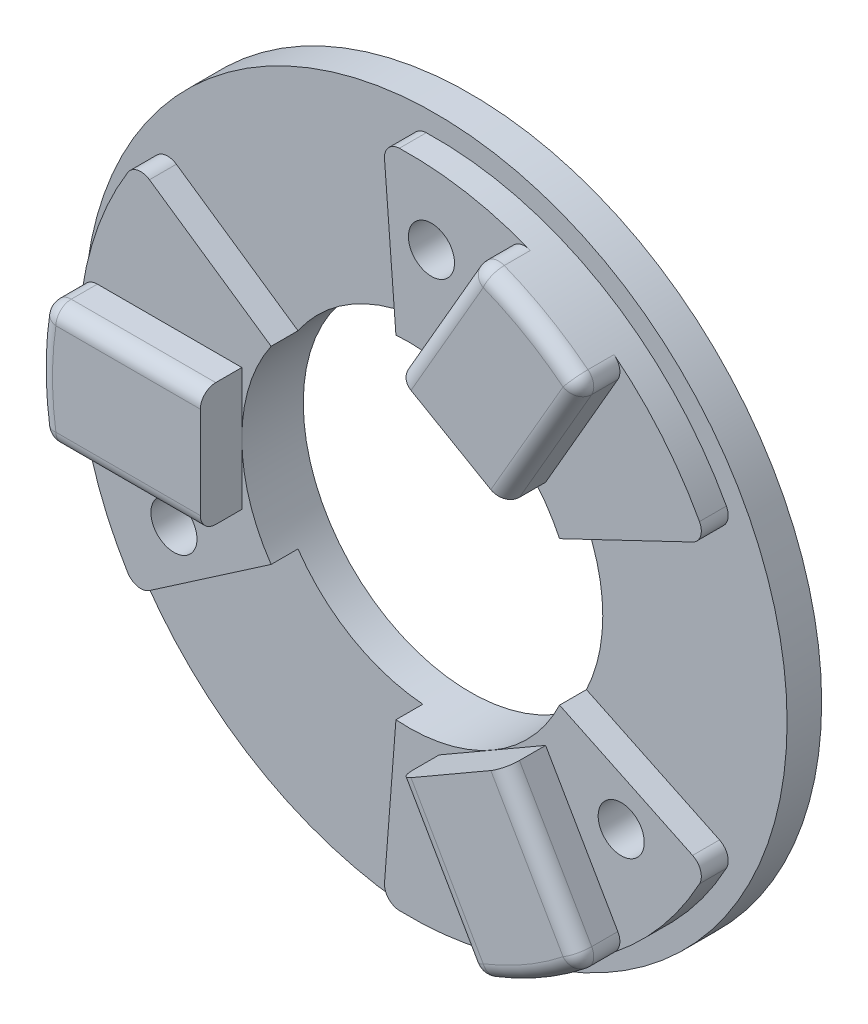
ISO-10303-21;
HEADER;
FILE_DESCRIPTION(('STEP AP214'),'2;1');
FILE_NAME('part.step','',(''),(''),'','','');
FILE_SCHEMA(('AUTOMOTIVE_DESIGN { 1 0 10303 214 1 1 1 1 }'));
ENDSEC;
DATA;
#1=APPLICATION_CONTEXT('core data for automotive mechanical design processes');
#2=APPLICATION_PROTOCOL_DEFINITION('international standard','automotive_design',2000,#1);
#3=PRODUCT_CONTEXT('',#1,'mechanical');
#4=PRODUCT('Part','Part','',(#3));
#5=PRODUCT_RELATED_PRODUCT_CATEGORY('part','',(#4));
#6=PRODUCT_DEFINITION_FORMATION('','',#4);
#7=PRODUCT_DEFINITION_CONTEXT('part definition',#1,'design');
#8=PRODUCT_DEFINITION('design','',#6,#7);
#9=PRODUCT_DEFINITION_SHAPE('','',#8);
#10=(LENGTH_UNIT() NAMED_UNIT(*) SI_UNIT(.MILLI.,.METRE.));
#11=(NAMED_UNIT(*) PLANE_ANGLE_UNIT() SI_UNIT($,.RADIAN.));
#12=(NAMED_UNIT(*) SI_UNIT($,.STERADIAN.) SOLID_ANGLE_UNIT());
#13=UNCERTAINTY_MEASURE_WITH_UNIT(LENGTH_MEASURE(1.E-05),#10,'distance_accuracy_value','');
#14=(GEOMETRIC_REPRESENTATION_CONTEXT(3) GLOBAL_UNCERTAINTY_ASSIGNED_CONTEXT((#13)) GLOBAL_UNIT_ASSIGNED_CONTEXT((#10,
#11,#12)) REPRESENTATION_CONTEXT('',''));
#15=CARTESIAN_POINT('',(0.,0.,0.));
#16=DIRECTION('',(0.,0.,1.));
#17=DIRECTION('',(1.,0.,0.));
#18=AXIS2_PLACEMENT_3D('',#15,#16,#17);
#19=CARTESIAN_POINT('',(-8.43749999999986,14.6141786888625,0.5));
#20=DIRECTION('',(0.,0.,-1.));
#21=DIRECTION('',(0.499999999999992,-0.866025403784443,0.));
#22=AXIS2_PLACEMENT_3D('',#19,#20,#21);
#23=PLANE('',#22);
#24=CARTESIAN_POINT('',(-8.43749999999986,14.6141786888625,0.5));
#25=DIRECTION('',(0.,0.,-1.));
#26=DIRECTION('',(0.499999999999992,-0.866025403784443,0.));
#27=AXIS2_PLACEMENT_3D('',#24,#25,#26);
#28=CIRCLE('',#27,4.625);
#29=CARTESIAN_POINT('',(-6.1249999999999,10.6088111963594,0.5));
#30=VERTEX_POINT('',#29);
#31=EDGE_CURVE('E704',#30,#30,#28,.T.);
#32=ORIENTED_EDGE('',*,*,#31,.T.);
#33=EDGE_LOOP('',(#32));
#34=FACE_BOUND('',#33,.T.);
#35=CARTESIAN_POINT('',(-8.43749999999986,14.6141786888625,0.5));
#36=DIRECTION('',(0.,0.,-1.));
#37=DIRECTION('',(0.499999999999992,-0.866025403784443,0.));
#38=AXIS2_PLACEMENT_3D('',#35,#36,#37);
#39=CIRCLE('',#38,3.);
#40=CARTESIAN_POINT('',(-6.93749999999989,12.0161024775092,0.5));
#41=VERTEX_POINT('',#40);
#42=EDGE_CURVE('E1311',#41,#41,#39,.T.);
#43=ORIENTED_EDGE('',*,*,#42,.F.);
#44=EDGE_LOOP('',(#43));
#45=FACE_BOUND('',#44,.T.);
#46=ADVANCED_FACE('F29',(#34,#45),#23,.T.);
#47=CARTESIAN_POINT('',(-8.43750000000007,-14.6141786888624,0.5));
#48=DIRECTION('',(0.,0.,-1.));
#49=DIRECTION('',(0.500000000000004,0.866025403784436,0.));
#50=AXIS2_PLACEMENT_3D('',#47,#48,#49);
#51=PLANE('',#50);
#52=CARTESIAN_POINT('',(-8.43750000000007,-14.6141786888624,0.5));
#53=DIRECTION('',(0.,0.,-1.));
#54=DIRECTION('',(0.500000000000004,0.866025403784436,0.));
#55=AXIS2_PLACEMENT_3D('',#52,#53,#54);
#56=CIRCLE('',#55,4.625);
#57=CARTESIAN_POINT('',(-6.12500000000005,-10.6088111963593,0.5));
#58=VERTEX_POINT('',#57);
#59=EDGE_CURVE('E699',#58,#58,#56,.T.);
#60=ORIENTED_EDGE('',*,*,#59,.T.);
#61=EDGE_LOOP('',(#60));
#62=FACE_BOUND('',#61,.T.);
#63=CARTESIAN_POINT('',(-8.43750000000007,-14.6141786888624,0.5));
#64=DIRECTION('',(0.,0.,-1.));
#65=DIRECTION('',(0.500000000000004,0.866025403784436,0.));
#66=AXIS2_PLACEMENT_3D('',#63,#64,#65);
#67=CIRCLE('',#66,3.);
#68=CARTESIAN_POINT('',(-6.93750000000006,-12.0161024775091,0.5));
#69=VERTEX_POINT('',#68);
#70=EDGE_CURVE('E1310',#69,#69,#67,.T.);
#71=ORIENTED_EDGE('',*,*,#70,.F.);
#72=EDGE_LOOP('',(#71));
#73=FACE_BOUND('',#72,.T.);
#74=ADVANCED_FACE('F635',(#62,#73),#51,.T.);
#75=CARTESIAN_POINT('',(0.,0.,0.));
#76=DIRECTION('',(0.,0.,1.));
#77=DIRECTION('',(1.,0.,0.));
#78=AXIS2_PLACEMENT_3D('',#75,#76,#77);
#79=PLANE('',#78);
#80=CARTESIAN_POINT('',(-8.43749999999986,14.6141786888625,0.));
#81=DIRECTION('',(0.,0.,-1.));
#82=DIRECTION('',(0.499999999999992,-0.866025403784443,0.));
#83=AXIS2_PLACEMENT_3D('',#80,#81,#82);
#84=CIRCLE('',#83,4.625);
#85=CARTESIAN_POINT('',(-6.1249999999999,10.6088111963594,0.));
#86=VERTEX_POINT('',#85);
#87=EDGE_CURVE('E708',#86,#86,#84,.T.);
#88=ORIENTED_EDGE('',*,*,#87,.F.);
#89=EDGE_LOOP('',(#88));
#90=FACE_BOUND('',#89,.T.);
#91=CARTESIAN_POINT('',(-8.43750000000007,-14.6141786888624,0.));
#92=DIRECTION('',(0.,0.,-1.));
#93=DIRECTION('',(0.500000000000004,0.866025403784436,0.));
#94=AXIS2_PLACEMENT_3D('',#91,#92,#93);
#95=CIRCLE('',#94,4.625);
#96=CARTESIAN_POINT('',(-6.12500000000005,-10.6088111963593,0.));
#97=VERTEX_POINT('',#96);
#98=EDGE_CURVE('E702',#97,#97,#95,.T.);
#99=ORIENTED_EDGE('',*,*,#98,.F.);
#100=EDGE_LOOP('',(#99));
#101=FACE_BOUND('',#100,.T.);
#102=CARTESIAN_POINT('',(-17.,2.34187669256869E-13,0.));
#103=DIRECTION('',(0.,0.,1.));
#104=DIRECTION('',(1.,0.,0.));
#105=AXIS2_PLACEMENT_3D('',#102,#103,#104);
#106=CIRCLE('',#105,3.375);
#107=CARTESIAN_POINT('',(-13.625,2.34187669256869E-13,0.));
#108=VERTEX_POINT('',#107);
#109=EDGE_CURVE('E37',#108,#108,#106,.F.);
#110=ORIENTED_EDGE('',*,*,#109,.F.);
#111=EDGE_LOOP('',(#110));
#112=FACE_BOUND('',#111,.T.);
#113=CARTESIAN_POINT('',(1.47075315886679,16.8107855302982,0.));
#114=DIRECTION('',(0.,0.,1.));
#115=DIRECTION('',(1.,0.,0.));
#116=AXIS2_PLACEMENT_3D('',#113,#114,#115);
#117=CIRCLE('',#116,1.5);
#118=CARTESIAN_POINT('',(2.97075315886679,16.8107855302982,0.));
#119=VERTEX_POINT('',#118);
#120=EDGE_CURVE('E624',#119,#119,#117,.T.);
#121=ORIENTED_EDGE('',*,*,#120,.T.);
#122=EDGE_LOOP('',(#121));
#123=FACE_BOUND('',#122,.T.);
#124=CARTESIAN_POINT('',(-15.2939439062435,-7.13168316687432,0.));
#125=DIRECTION('',(0.,0.,1.));
#126=DIRECTION('',(1.,0.,0.));
#127=AXIS2_PLACEMENT_3D('',#124,#125,#126);
#128=CIRCLE('',#127,1.5);
#129=CARTESIAN_POINT('',(-13.7939439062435,-7.13168316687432,0.));
#130=VERTEX_POINT('',#129);
#131=EDGE_CURVE('E619',#130,#130,#128,.T.);
#132=ORIENTED_EDGE('',*,*,#131,.T.);
#133=EDGE_LOOP('',(#132));
#134=FACE_BOUND('',#133,.T.);
#135=CARTESIAN_POINT('',(16.875,0.,0.));
#136=DIRECTION('',(0.,0.,-1.));
#137=DIRECTION('',(-1.,0.,0.));
#138=AXIS2_PLACEMENT_3D('',#135,#136,#137);
#139=CIRCLE('',#138,4.625);
#140=CARTESIAN_POINT('',(12.25,0.,0.));
#141=VERTEX_POINT('',#140);
#142=EDGE_CURVE('E419',#141,#141,#139,.T.);
#143=ORIENTED_EDGE('',*,*,#142,.F.);
#144=EDGE_LOOP('',(#143));
#145=FACE_BOUND('',#144,.T.);
#146=CARTESIAN_POINT('',(0.,0.,0.));
#147=DIRECTION('',(0.,0.,1.));
#148=DIRECTION('',(1.,0.,0.));
#149=AXIS2_PLACEMENT_3D('',#146,#147,#148);
#150=CIRCLE('',#149,10.875);
#151=CARTESIAN_POINT('',(10.875,0.,0.));
#152=VERTEX_POINT('',#151);
#153=EDGE_CURVE('E498',#152,#152,#150,.T.);
#154=ORIENTED_EDGE('',*,*,#153,.T.);
#155=EDGE_LOOP('',(#154));
#156=FACE_BOUND('',#155,.T.);
#157=CARTESIAN_POINT('',(0.,0.,0.));
#158=DIRECTION('',(0.,0.,1.));
#159=DIRECTION('',(1.,0.,0.));
#160=AXIS2_PLACEMENT_3D('',#157,#158,#159);
#161=CIRCLE('',#160,22.875);
#162=CARTESIAN_POINT('',(22.875,0.,0.));
#163=VERTEX_POINT('',#162);
#164=EDGE_CURVE('E509',#163,#163,#161,.T.);
#165=ORIENTED_EDGE('',*,*,#164,.F.);
#166=EDGE_LOOP('',(#165));
#167=FACE_BOUND('',#166,.T.);
#168=CARTESIAN_POINT('',(13.8231907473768,-9.67910236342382,0.));
#169=DIRECTION('',(0.,0.,1.));
#170=DIRECTION('',(1.,0.,0.));
#171=AXIS2_PLACEMENT_3D('',#168,#169,#170);
#172=CIRCLE('',#171,1.5);
#173=CARTESIAN_POINT('',(15.3231907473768,-9.67910236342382,0.));
#174=VERTEX_POINT('',#173);
#175=EDGE_CURVE('E431',#174,#174,#172,.T.);
#176=ORIENTED_EDGE('',*,*,#175,.T.);
#177=EDGE_LOOP('',(#176));
#178=FACE_BOUND('',#177,.T.);
#179=CARTESIAN_POINT('',(8.49999999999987,-14.7224318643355,0.));
#180=DIRECTION('',(0.,0.,1.));
#181=DIRECTION('',(1.,0.,0.));
#182=AXIS2_PLACEMENT_3D('',#179,#180,#181);
#183=CIRCLE('',#182,3.375);
#184=CARTESIAN_POINT('',(11.8749999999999,-14.7224318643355,0.));
#185=VERTEX_POINT('',#184);
#186=EDGE_CURVE('E521',#185,#185,#183,.F.);
#187=ORIENTED_EDGE('',*,*,#186,.F.);
#188=EDGE_LOOP('',(#187));
#189=FACE_BOUND('',#188,.T.);
#190=CARTESIAN_POINT('',(8.50000000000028,14.7224318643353,0.));
#191=DIRECTION('',(0.,0.,1.));
#192=DIRECTION('',(1.,0.,0.));
#193=AXIS2_PLACEMENT_3D('',#190,#191,#192);
#194=CIRCLE('',#193,3.375);
#195=CARTESIAN_POINT('',(11.8750000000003,14.7224318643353,0.));
#196=VERTEX_POINT('',#195);
#197=EDGE_CURVE('E11',#196,#196,#194,.F.);
#198=ORIENTED_EDGE('',*,*,#197,.F.);
#199=EDGE_LOOP('',(#198));
#200=FACE_BOUND('',#199,.T.);
#201=ADVANCED_FACE('F632',(#90,#101,#112,#123,#134,#145,#156,#167,#178,#189,#200),#79,.F.);
#202=CARTESIAN_POINT('',(0.,0.,4.));
#203=DIRECTION('',(0.,0.,1.));
#204=DIRECTION('',(-0.499999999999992,0.866025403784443,0.));
#205=AXIS2_PLACEMENT_3D('',#202,#203,#204);
#206=PLANE('',#205);
#207=DIRECTION('',(0.902142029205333,0.431439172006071,0.));
#208=VECTOR('',#207,1.);
#209=CARTESIAN_POINT('',(9.81079456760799,4.69190099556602,4.));
#210=LINE('',#209,#208);
#211=CARTESIAN_POINT('',(9.81079456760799,4.69190099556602,4.));
#212=VERTEX_POINT('',#211);
#213=CARTESIAN_POINT('',(18.471895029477,8.83397385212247,4.));
#214=VERTEX_POINT('',#213);
#215=EDGE_CURVE('E375',#212,#214,#210,.T.);
#216=ORIENTED_EDGE('',*,*,#215,.T.);
#217=CARTESIAN_POINT('',(18.0404558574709,9.7361158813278,4.));
#218=DIRECTION('',(0.,0.,1.));
#219=DIRECTION('',(1.,0.,0.));
#220=AXIS2_PLACEMENT_3D('',#217,#218,#219);
#221=CIRCLE('',#220,1.);
#222=CARTESIAN_POINT('',(18.9204780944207,10.2110483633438,4.));
#223=VERTEX_POINT('',#222);
#224=EDGE_CURVE('E601',#214,#223,#221,.T.);
#225=ORIENTED_EDGE('',*,*,#224,.T.);
#226=CARTESIAN_POINT('',(0.,0.,4.));
#227=DIRECTION('',(0.,0.,1.));
#228=DIRECTION('',(-0.499999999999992,0.866025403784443,0.));
#229=AXIS2_PLACEMENT_3D('',#226,#227,#228);
#230=CIRCLE('',#229,21.5);
#231=CARTESIAN_POINT('',(13.3590785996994,16.8459199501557,4.));
#232=VERTEX_POINT('',#231);
#233=EDGE_CURVE('E378',#223,#232,#230,.T.);
#234=ORIENTED_EDGE('',*,*,#233,.T.);
#235=CARTESIAN_POINT('',(12.7377261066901,16.0623887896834,4.));
#236=DIRECTION('',(0.,0.,1.));
#237=DIRECTION('',(1.,0.,0.));
#238=AXIS2_PLACEMENT_3D('',#235,#236,#237);
#239=CIRCLE('',#238,1.);
#240=CARTESIAN_POINT('',(13.6037515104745,15.5623887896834,4.));
#241=VERTEX_POINT('',#240);
#242=EDGE_CURVE('E334',#232,#241,#239,.F.);
#243=ORIENTED_EDGE('',*,*,#242,.T.);
#244=DIRECTION('',(0.500000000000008,0.866025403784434,0.));
#245=VECTOR('',#244,1.);
#246=CARTESIAN_POINT('',(8.90160161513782,7.41802626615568,4.));
#247=LINE('',#246,#245);
#248=CARTESIAN_POINT('',(8.90160161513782,7.41802626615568,4.));
#249=VERTEX_POINT('',#248);
#250=EDGE_CURVE('E311',#249,#241,#247,.T.);
#251=ORIENTED_EDGE('',*,*,#250,.F.);
#252=DIRECTION('',(-0.866025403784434,0.500000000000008,0.));
#253=VECTOR('',#252,1.);
#254=CARTESIAN_POINT('',(5.43750000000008,9.41802626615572,4.));
#255=LINE('',#254,#253);
#256=CARTESIAN_POINT('',(5.43750000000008,9.41802626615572,4.));
#257=VERTEX_POINT('',#256);
#258=EDGE_CURVE('E321',#249,#257,#255,.T.);
#259=ORIENTED_EDGE('',*,*,#258,.T.);
#260=CARTESIAN_POINT('',(0.,0.,4.));
#261=DIRECTION('',(0.,0.,-1.));
#262=DIRECTION('',(-0.499999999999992,0.866025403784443,0.));
#263=AXIS2_PLACEMENT_3D('',#260,#261,#262);
#264=CIRCLE('',#263,10.875);
#265=EDGE_CURVE('E371',#257,#212,#264,.T.);
#266=ORIENTED_EDGE('',*,*,#265,.T.);
#267=EDGE_LOOP('',(#216,#225,#234,#243,#251,#259,#266));
#268=FACE_BOUND('',#267,.T.);
#269=ADVANCED_FACE('F332',(#268),#206,.T.);
#270=CARTESIAN_POINT('',(1.47075315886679,16.8107855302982,4.));
#271=DIRECTION('',(0.,0.,1.));
#272=DIRECTION('',(-0.499999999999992,0.866025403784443,0.));
#273=AXIS2_PLACEMENT_3D('',#270,#271,#272);
#274=CIRCLE('',#273,1.5);
#275=CARTESIAN_POINT('',(0.720753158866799,18.1098236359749,4.));
#276=VERTEX_POINT('',#275);
#277=EDGE_CURVE('E626',#276,#276,#274,.T.);
#278=ORIENTED_EDGE('',*,*,#277,.F.);
#279=EDGE_LOOP('',(#278));
#280=FACE_BOUND('',#279,.T.);
#281=CARTESIAN_POINT('',(7.90945532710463,19.9922614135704,4.));
#282=VERTEX_POINT('',#281);
#283=CARTESIAN_POINT('',(-0.617211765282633,21.4911388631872,4.));
#284=VERTEX_POINT('',#283);
#285=EDGE_CURVE('E377',#282,#284,#230,.T.);
#286=ORIENTED_EDGE('',*,*,#285,.T.);
#287=CARTESIAN_POINT('',(-0.588504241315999,20.4915510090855,4.));
#288=DIRECTION('',(0.,0.,1.));
#289=DIRECTION('',(1.,0.,0.));
#290=AXIS2_PLACEMENT_3D('',#287,#288,#289);
#291=CIRCLE('',#290,1.);
#292=CARTESIAN_POINT('',(-1.5855017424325,20.4141172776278,4.));
#293=VERTEX_POINT('',#292);
#294=EDGE_CURVE('E597',#284,#293,#291,.T.);
#295=ORIENTED_EDGE('',*,*,#294,.T.);
#296=DIRECTION('',(0.0774337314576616,-0.996997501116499,0.));
#297=VECTOR('',#296,1.);
#298=CARTESIAN_POINT('',(-0.842091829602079,10.8423478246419,4.));
#299=LINE('',#298,#297);
#300=CARTESIAN_POINT('',(-0.842091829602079,10.8423478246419,4.));
#301=VERTEX_POINT('',#300);
#302=EDGE_CURVE('E380',#293,#301,#299,.T.);
#303=ORIENTED_EDGE('',*,*,#302,.T.);
#304=EDGE_CURVE('E372',#301,#257,#264,.T.);
#305=ORIENTED_EDGE('',*,*,#304,.T.);
#306=DIRECTION('',(0.866025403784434,-0.500000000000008,0.));
#307=VECTOR('',#306,1.);
#308=CARTESIAN_POINT('',(8.90160161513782,7.41802626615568,4.));
#309=LINE('',#308,#307);
#310=CARTESIAN_POINT('',(1.97339838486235,11.4180262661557,4.));
#311=VERTEX_POINT('',#310);
#312=EDGE_CURVE('E325',#311,#257,#309,.T.);
#313=ORIENTED_EDGE('',*,*,#312,.F.);
#314=DIRECTION('',(-0.500000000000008,-0.866025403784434,0.));
#315=VECTOR('',#314,1.);
#316=CARTESIAN_POINT('',(1.97339838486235,11.4180262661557,4.));
#317=LINE('',#316,#315);
#318=CARTESIAN_POINT('',(6.67554828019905,19.5623887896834,4.));
#319=VERTEX_POINT('',#318);
#320=EDGE_CURVE('E335',#319,#311,#317,.T.);
#321=ORIENTED_EDGE('',*,*,#320,.F.);
#322=CARTESIAN_POINT('',(7.54157368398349,19.0623887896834,4.));
#323=DIRECTION('',(0.,0.,1.));
#324=DIRECTION('',(1.,0.,0.));
#325=AXIS2_PLACEMENT_3D('',#322,#323,#324);
#326=CIRCLE('',#325,1.);
#327=EDGE_CURVE('E611',#319,#282,#326,.F.);
#328=ORIENTED_EDGE('',*,*,#327,.T.);
#329=EDGE_LOOP('',(#286,#295,#303,#305,#313,#321,#328));
#330=FACE_BOUND('',#329,.T.);
#331=ADVANCED_FACE('F1074',(#280,#330),#206,.T.);
#332=CARTESIAN_POINT('',(0.,0.,4.));
#333=DIRECTION('',(0.,0.,1.));
#334=DIRECTION('',(-0.500000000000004,-0.866025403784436,0.));
#335=AXIS2_PLACEMENT_3D('',#332,#333,#334);
#336=PLANE('',#335);
#337=DIRECTION('',(-0.824708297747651,0.565558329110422,0.));
#338=VECTOR('',#337,1.);
#339=CARTESIAN_POINT('',(-8.96870273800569,6.15044682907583,4.));
#340=LINE('',#339,#338);
#341=CARTESIAN_POINT('',(-8.96870273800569,6.15044682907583,4.));
#342=VERTEX_POINT('',#341);
#343=CARTESIAN_POINT('',(-16.8863932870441,11.5801434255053,4.));
#344=VERTEX_POINT('',#343);
#345=EDGE_CURVE('E399',#342,#344,#340,.T.);
#346=ORIENTED_EDGE('',*,*,#345,.T.);
#347=CARTESIAN_POINT('',(-17.4519516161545,10.7554351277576,4.));
#348=DIRECTION('',(0.,0.,1.));
#349=DIRECTION('',(1.,0.,0.));
#350=AXIS2_PLACEMENT_3D('',#347,#348,#349);
#351=CIRCLE('',#350,1.);
#352=CARTESIAN_POINT('',(-18.3032663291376,11.2800904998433,4.));
#353=VERTEX_POINT('',#352);
#354=EDGE_CURVE('E553',#344,#353,#351,.T.);
#355=ORIENTED_EDGE('',*,*,#354,.T.);
#356=CARTESIAN_POINT('',(0.,0.,4.));
#357=DIRECTION('',(0.,0.,1.));
#358=DIRECTION('',(-0.500000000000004,-0.866025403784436,0.));
#359=AXIS2_PLACEMENT_3D('',#356,#357,#358);
#360=CIRCLE('',#359,21.5);
#361=CARTESIAN_POINT('',(-21.2685339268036,3.14634146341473,4.));
#362=VERTEX_POINT('',#361);
#363=EDGE_CURVE('E403',#353,#362,#360,.T.);
#364=ORIENTED_EDGE('',*,*,#363,.T.);
#365=CARTESIAN_POINT('',(-20.2792997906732,3.00000000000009,4.));
#366=DIRECTION('',(0.,0.,1.));
#367=DIRECTION('',(1.,0.,0.));
#368=AXIS2_PLACEMENT_3D('',#365,#366,#367);
#369=CIRCLE('',#368,1.);
#370=CARTESIAN_POINT('',(-20.2792997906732,4.00000000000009,4.));
#371=VERTEX_POINT('',#370);
#372=EDGE_CURVE('E568',#362,#371,#369,.F.);
#373=ORIENTED_EDGE('',*,*,#372,.T.);
#374=DIRECTION('',(-1.,0.,0.));
#375=VECTOR('',#374,1.);
#376=CARTESIAN_POINT('',(-10.875,4.00000000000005,4.));
#377=LINE('',#376,#375);
#378=CARTESIAN_POINT('',(-10.875,4.00000000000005,4.));
#379=VERTEX_POINT('',#378);
#380=EDGE_CURVE('E348',#379,#371,#377,.T.);
#381=ORIENTED_EDGE('',*,*,#380,.F.);
#382=DIRECTION('',(0.,-1.,0.));
#383=VECTOR('',#382,1.);
#384=CARTESIAN_POINT('',(-10.875,0.,4.));
#385=LINE('',#384,#383);
#386=CARTESIAN_POINT('',(-10.875,0.,4.));
#387=VERTEX_POINT('',#386);
#388=EDGE_CURVE('E329',#379,#387,#385,.T.);
#389=ORIENTED_EDGE('',*,*,#388,.T.);
#390=CARTESIAN_POINT('',(0.,0.,4.));
#391=DIRECTION('',(0.,0.,-1.));
#392=DIRECTION('',(-0.500000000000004,-0.866025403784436,0.));
#393=AXIS2_PLACEMENT_3D('',#390,#391,#392);
#394=CIRCLE('',#393,10.875);
#395=EDGE_CURVE('E395',#387,#342,#394,.T.);
#396=ORIENTED_EDGE('',*,*,#395,.T.);
#397=EDGE_LOOP('',(#346,#355,#364,#373,#381,#389,#396));
#398=FACE_BOUND('',#397,.T.);
#399=ADVANCED_FACE('F801',(#398),#336,.T.);
#400=CARTESIAN_POINT('',(-15.2939439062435,-7.13168316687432,4.));
#401=DIRECTION('',(0.,0.,1.));
#402=DIRECTION('',(-0.500000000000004,-0.866025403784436,0.));
#403=AXIS2_PLACEMENT_3D('',#400,#401,#402);
#404=CIRCLE('',#403,1.5);
#405=CARTESIAN_POINT('',(-16.0439439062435,-8.43072127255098,4.));
#406=VERTEX_POINT('',#405);
#407=EDGE_CURVE('E623',#406,#406,#404,.T.);
#408=ORIENTED_EDGE('',*,*,#407,.F.);
#409=EDGE_LOOP('',(#408));
#410=FACE_BOUND('',#409,.T.);
#411=CARTESIAN_POINT('',(-21.2685339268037,-3.14634146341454,4.));
#412=VERTEX_POINT('',#411);
#413=CARTESIAN_POINT('',(-18.3032663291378,-11.2800904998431,4.));
#414=VERTEX_POINT('',#413);
#415=EDGE_CURVE('E402',#412,#414,#360,.T.);
#416=ORIENTED_EDGE('',*,*,#415,.T.);
#417=CARTESIAN_POINT('',(-17.4519516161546,-10.7554351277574,4.));
#418=DIRECTION('',(0.,0.,1.));
#419=DIRECTION('',(1.,0.,0.));
#420=AXIS2_PLACEMENT_3D('',#417,#418,#419);
#421=CIRCLE('',#420,1.);
#422=CARTESIAN_POINT('',(-16.8863932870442,-11.580143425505,4.));
#423=VERTEX_POINT('',#422);
#424=EDGE_CURVE('E549',#414,#423,#421,.T.);
#425=ORIENTED_EDGE('',*,*,#424,.T.);
#426=DIRECTION('',(0.824708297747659,0.56555832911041,0.));
#427=VECTOR('',#426,1.);
#428=CARTESIAN_POINT('',(-8.96870273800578,-6.15044682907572,4.));
#429=LINE('',#428,#427);
#430=CARTESIAN_POINT('',(-8.96870273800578,-6.15044682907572,4.));
#431=VERTEX_POINT('',#430);
#432=EDGE_CURVE('E405',#423,#431,#429,.T.);
#433=ORIENTED_EDGE('',*,*,#432,.T.);
#434=EDGE_CURVE('E396',#431,#387,#394,.T.);
#435=ORIENTED_EDGE('',*,*,#434,.T.);
#436=DIRECTION('',(0.,1.,0.));
#437=VECTOR('',#436,1.);
#438=CARTESIAN_POINT('',(-10.875,4.00000000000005,4.));
#439=LINE('',#438,#437);
#440=CARTESIAN_POINT('',(-10.875,-3.99999999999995,4.));
#441=VERTEX_POINT('',#440);
#442=EDGE_CURVE('E354',#441,#387,#439,.T.);
#443=ORIENTED_EDGE('',*,*,#442,.F.);
#444=DIRECTION('',(1.,0.,0.));
#445=VECTOR('',#444,1.);
#446=CARTESIAN_POINT('',(-10.875,-3.99999999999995,4.));
#447=LINE('',#446,#445);
#448=CARTESIAN_POINT('',(-20.2792997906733,-3.99999999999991,4.));
#449=VERTEX_POINT('',#448);
#450=EDGE_CURVE('E351',#449,#441,#447,.T.);
#451=ORIENTED_EDGE('',*,*,#450,.F.);
#452=CARTESIAN_POINT('',(-20.2792997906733,-2.9999999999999,4.));
#453=DIRECTION('',(0.,0.,1.));
#454=DIRECTION('',(1.,0.,0.));
#455=AXIS2_PLACEMENT_3D('',#452,#453,#454);
#456=CIRCLE('',#455,1.);
#457=EDGE_CURVE('E565',#449,#412,#456,.F.);
#458=ORIENTED_EDGE('',*,*,#457,.T.);
#459=EDGE_LOOP('',(#416,#425,#433,#435,#443,#451,#458));
#460=FACE_BOUND('',#459,.T.);
#461=ADVANCED_FACE('F792',(#410,#460),#336,.T.);
#462=CARTESIAN_POINT('',(0.,0.,2.25));
#463=DIRECTION('',(0.,0.,1.));
#464=DIRECTION('',(1.,0.,0.));
#465=AXIS2_PLACEMENT_3D('',#462,#463,#464);
#466=PLANE('',#465);
#467=CARTESIAN_POINT('',(0.,0.,2.25));
#468=DIRECTION('',(0.,0.,1.));
#469=DIRECTION('',(1.,0.,0.));
#470=AXIS2_PLACEMENT_3D('',#467,#468,#469);
#471=CIRCLE('',#470,22.875);
#472=CARTESIAN_POINT('',(22.875,0.,2.25));
#473=VERTEX_POINT('',#472);
#474=EDGE_CURVE('E513',#473,#473,#471,.T.);
#475=ORIENTED_EDGE('',*,*,#474,.T.);
#476=EDGE_LOOP('',(#475));
#477=FACE_BOUND('',#476,.T.);
#478=CARTESIAN_POINT('',(0.,0.,2.25));
#479=DIRECTION('',(0.,0.,1.));
#480=DIRECTION('',(-0.499999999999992,0.866025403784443,0.));
#481=AXIS2_PLACEMENT_3D('',#478,#479,#480);
#482=CIRCLE('',#481,21.5);
#483=CARTESIAN_POINT('',(18.9204780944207,10.2110483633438,2.25));
#484=VERTEX_POINT('',#483);
#485=CARTESIAN_POINT('',(-0.617211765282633,21.4911388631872,2.25));
#486=VERTEX_POINT('',#485);
#487=EDGE_CURVE('E366',#484,#486,#482,.T.);
#488=ORIENTED_EDGE('',*,*,#487,.F.);
#489=CARTESIAN_POINT('',(18.0404558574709,9.7361158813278,2.25));
#490=DIRECTION('',(0.,0.,1.));
#491=DIRECTION('',(1.,0.,0.));
#492=AXIS2_PLACEMENT_3D('',#489,#490,#491);
#493=CIRCLE('',#492,1.);
#494=CARTESIAN_POINT('',(18.471895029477,8.83397385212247,2.25));
#495=VERTEX_POINT('',#494);
#496=EDGE_CURVE('E617',#484,#495,#493,.F.);
#497=ORIENTED_EDGE('',*,*,#496,.T.);
#498=DIRECTION('',(0.902142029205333,0.431439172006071,0.));
#499=VECTOR('',#498,1.);
#500=CARTESIAN_POINT('',(9.81079456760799,4.69190099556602,2.25));
#501=LINE('',#500,#499);
#502=CARTESIAN_POINT('',(9.81079456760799,4.69190099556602,2.25));
#503=VERTEX_POINT('',#502);
#504=EDGE_CURVE('E363',#503,#495,#501,.T.);
#505=ORIENTED_EDGE('',*,*,#504,.F.);
#506=CARTESIAN_POINT('',(0.,0.,2.25));
#507=DIRECTION('',(0.,0.,1.));
#508=DIRECTION('',(1.,0.,0.));
#509=AXIS2_PLACEMENT_3D('',#506,#507,#508);
#510=CIRCLE('',#509,10.875);
#511=CARTESIAN_POINT('',(9.81079456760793,-4.69190099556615,2.25));
#512=VERTEX_POINT('',#511);
#513=EDGE_CURVE('E506',#512,#503,#510,.T.);
#514=ORIENTED_EDGE('',*,*,#513,.F.);
#515=DIRECTION('',(-0.902142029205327,0.431439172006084,0.));
#516=VECTOR('',#515,1.);
#517=CARTESIAN_POINT('',(9.81079456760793,-4.69190099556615,2.25));
#518=LINE('',#517,#516);
#519=CARTESIAN_POINT('',(18.4718950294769,-8.83397385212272,2.25));
#520=VERTEX_POINT('',#519);
#521=EDGE_CURVE('E846',#520,#512,#518,.T.);
#522=ORIENTED_EDGE('',*,*,#521,.F.);
#523=CARTESIAN_POINT('',(18.0404558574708,-9.73611588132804,2.25));
#524=DIRECTION('',(0.,0.,1.));
#525=DIRECTION('',(1.,0.,0.));
#526=AXIS2_PLACEMENT_3D('',#523,#524,#525);
#527=CIRCLE('',#526,1.);
#528=CARTESIAN_POINT('',(18.9204780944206,-10.211048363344,2.25));
#529=VERTEX_POINT('',#528);
#530=EDGE_CURVE('E973',#520,#529,#527,.F.);
#531=ORIENTED_EDGE('',*,*,#530,.T.);
#532=CARTESIAN_POINT('',(0.,0.,2.25));
#533=DIRECTION('',(0.,0.,1.));
#534=DIRECTION('',(1.,0.,0.));
#535=AXIS2_PLACEMENT_3D('',#532,#533,#534);
#536=CIRCLE('',#535,21.5);
#537=CARTESIAN_POINT('',(-0.617211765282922,-21.4911388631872,2.25));
#538=VERTEX_POINT('',#537);
#539=EDGE_CURVE('E504',#538,#529,#536,.T.);
#540=ORIENTED_EDGE('',*,*,#539,.F.);
#541=CARTESIAN_POINT('',(-0.588504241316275,-20.4915510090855,2.25));
#542=DIRECTION('',(0.,0.,1.));
#543=DIRECTION('',(1.,0.,0.));
#544=AXIS2_PLACEMENT_3D('',#541,#542,#543);
#545=CIRCLE('',#544,1.);
#546=CARTESIAN_POINT('',(-1.58550174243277,-20.4141172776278,2.25));
#547=VERTEX_POINT('',#546);
#548=EDGE_CURVE('E834',#538,#547,#545,.F.);
#549=ORIENTED_EDGE('',*,*,#548,.T.);
#550=DIRECTION('',(-0.0774337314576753,-0.996997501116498,0.));
#551=VECTOR('',#550,1.);
#552=CARTESIAN_POINT('',(-0.842091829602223,-10.8423478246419,2.25));
#553=LINE('',#552,#551);
#554=CARTESIAN_POINT('',(-0.842091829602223,-10.8423478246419,2.25));
#555=VERTEX_POINT('',#554);
#556=EDGE_CURVE('E501',#555,#547,#553,.T.);
#557=ORIENTED_EDGE('',*,*,#556,.F.);
#558=CARTESIAN_POINT('',(-8.96870273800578,-6.15044682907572,2.25));
#559=VERTEX_POINT('',#558);
#560=EDGE_CURVE('E519',#559,#555,#510,.T.);
#561=ORIENTED_EDGE('',*,*,#560,.F.);
#562=DIRECTION('',(0.824708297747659,0.56555832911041,0.));
#563=VECTOR('',#562,1.);
#564=CARTESIAN_POINT('',(-8.96870273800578,-6.15044682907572,2.25));
#565=LINE('',#564,#563);
#566=CARTESIAN_POINT('',(-16.8863932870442,-11.580143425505,2.25));
#567=VERTEX_POINT('',#566);
#568=EDGE_CURVE('E393',#567,#559,#565,.T.);
#569=ORIENTED_EDGE('',*,*,#568,.F.);
#570=CARTESIAN_POINT('',(-17.4519516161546,-10.7554351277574,2.25));
#571=DIRECTION('',(0.,0.,1.));
#572=DIRECTION('',(1.,0.,0.));
#573=AXIS2_PLACEMENT_3D('',#570,#571,#572);
#574=CIRCLE('',#573,1.);
#575=CARTESIAN_POINT('',(-18.3032663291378,-11.2800904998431,2.25));
#576=VERTEX_POINT('',#575);
#577=EDGE_CURVE('E570',#567,#576,#574,.F.);
#578=ORIENTED_EDGE('',*,*,#577,.T.);
#579=CARTESIAN_POINT('',(0.,0.,2.25));
#580=DIRECTION('',(0.,0.,1.));
#581=DIRECTION('',(-0.500000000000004,-0.866025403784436,0.));
#582=AXIS2_PLACEMENT_3D('',#579,#580,#581);
#583=CIRCLE('',#582,21.5);
#584=CARTESIAN_POINT('',(-18.3032663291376,11.2800904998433,2.25));
#585=VERTEX_POINT('',#584);
#586=EDGE_CURVE('E390',#585,#576,#583,.T.);
#587=ORIENTED_EDGE('',*,*,#586,.F.);
#588=CARTESIAN_POINT('',(-17.4519516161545,10.7554351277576,2.25));
#589=DIRECTION('',(0.,0.,1.));
#590=DIRECTION('',(1.,0.,0.));
#591=AXIS2_PLACEMENT_3D('',#588,#589,#590);
#592=CIRCLE('',#591,1.);
#593=CARTESIAN_POINT('',(-16.8863932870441,11.5801434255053,2.25));
#594=VERTEX_POINT('',#593);
#595=EDGE_CURVE('E572',#585,#594,#592,.F.);
#596=ORIENTED_EDGE('',*,*,#595,.T.);
#597=DIRECTION('',(-0.824708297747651,0.565558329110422,0.));
#598=VECTOR('',#597,1.);
#599=CARTESIAN_POINT('',(-8.96870273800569,6.15044682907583,2.25));
#600=LINE('',#599,#598);
#601=CARTESIAN_POINT('',(-8.96870273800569,6.15044682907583,2.25));
#602=VERTEX_POINT('',#601);
#603=EDGE_CURVE('E387',#602,#594,#600,.T.);
#604=ORIENTED_EDGE('',*,*,#603,.F.);
#605=CARTESIAN_POINT('',(-0.84209182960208,10.8423478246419,2.25));
#606=VERTEX_POINT('',#605);
#607=EDGE_CURVE('E510',#606,#602,#510,.T.);
#608=ORIENTED_EDGE('',*,*,#607,.F.);
#609=DIRECTION('',(0.0774337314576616,-0.996997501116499,0.));
#610=VECTOR('',#609,1.);
#611=CARTESIAN_POINT('',(-0.842091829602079,10.8423478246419,2.25));
#612=LINE('',#611,#610);
#613=CARTESIAN_POINT('',(-1.5855017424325,20.4141172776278,2.25));
#614=VERTEX_POINT('',#613);
#615=EDGE_CURVE('E369',#614,#606,#612,.T.);
#616=ORIENTED_EDGE('',*,*,#615,.F.);
#617=CARTESIAN_POINT('',(-0.588504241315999,20.4915510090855,2.25));
#618=DIRECTION('',(0.,0.,1.));
#619=DIRECTION('',(1.,0.,0.));
#620=AXIS2_PLACEMENT_3D('',#617,#618,#619);
#621=CIRCLE('',#620,1.);
#622=EDGE_CURVE('E615',#614,#486,#621,.F.);
#623=ORIENTED_EDGE('',*,*,#622,.T.);
#624=EDGE_LOOP('',(#488,#497,#505,#514,#522,#531,#540,#549,#557,#561,#569,#578,#587,#596,#604,
#608,#616,#623));
#625=FACE_BOUND('',#624,.T.);
#626=ADVANCED_FACE('F814',(#477,#625),#466,.T.);
#627=CARTESIAN_POINT('',(16.875,0.,0.5));
#628=DIRECTION('',(0.,0.,-1.));
#629=DIRECTION('',(-1.,0.,0.));
#630=AXIS2_PLACEMENT_3D('',#627,#628,#629);
#631=PLANE('',#630);
#632=CARTESIAN_POINT('',(16.875,0.,0.5));
#633=DIRECTION('',(0.,0.,-1.));
#634=DIRECTION('',(-1.,0.,0.));
#635=AXIS2_PLACEMENT_3D('',#632,#633,#634);
#636=CIRCLE('',#635,4.625);
#637=CARTESIAN_POINT('',(12.25,0.,0.5));
#638=VERTEX_POINT('',#637);
#639=EDGE_CURVE('E422',#638,#638,#636,.T.);
#640=ORIENTED_EDGE('',*,*,#639,.T.);
#641=EDGE_LOOP('',(#640));
#642=FACE_BOUND('',#641,.T.);
#643=CARTESIAN_POINT('',(16.875,0.,0.5));
#644=DIRECTION('',(0.,0.,-1.));
#645=DIRECTION('',(-1.,0.,0.));
#646=AXIS2_PLACEMENT_3D('',#643,#644,#645);
#647=CIRCLE('',#646,3.);
#648=CARTESIAN_POINT('',(13.875,0.,0.5));
#649=VERTEX_POINT('',#648);
#650=EDGE_CURVE('E413',#649,#649,#647,.T.);
#651=ORIENTED_EDGE('',*,*,#650,.F.);
#652=EDGE_LOOP('',(#651));
#653=FACE_BOUND('',#652,.T.);
#654=ADVANCED_FACE('F875',(#642,#653),#631,.T.);
#655=CARTESIAN_POINT('',(0.,0.,4.));
#656=DIRECTION('',(0.,0.,1.));
#657=DIRECTION('',(1.,0.,0.));
#658=AXIS2_PLACEMENT_3D('',#655,#656,#657);
#659=PLANE('',#658);
#660=DIRECTION('',(-0.0774337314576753,-0.996997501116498,0.));
#661=VECTOR('',#660,1.);
#662=CARTESIAN_POINT('',(-0.842091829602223,-10.8423478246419,4.));
#663=LINE('',#662,#661);
#664=CARTESIAN_POINT('',(-0.842091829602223,-10.8423478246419,4.));
#665=VERTEX_POINT('',#664);
#666=CARTESIAN_POINT('',(-1.58550174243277,-20.4141172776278,4.));
#667=VERTEX_POINT('',#666);
#668=EDGE_CURVE('E482',#665,#667,#663,.T.);
#669=ORIENTED_EDGE('',*,*,#668,.T.);
#670=CARTESIAN_POINT('',(-0.588504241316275,-20.4915510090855,4.));
#671=DIRECTION('',(0.,0.,1.));
#672=DIRECTION('',(1.,0.,0.));
#673=AXIS2_PLACEMENT_3D('',#670,#671,#672);
#674=CIRCLE('',#673,1.);
#675=CARTESIAN_POINT('',(-0.617211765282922,-21.4911388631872,4.));
#676=VERTEX_POINT('',#675);
#677=EDGE_CURVE('E1028',#667,#676,#674,.T.);
#678=ORIENTED_EDGE('',*,*,#677,.T.);
#679=CARTESIAN_POINT('',(0.,0.,4.));
#680=DIRECTION('',(0.,0.,1.));
#681=DIRECTION('',(1.,0.,0.));
#682=AXIS2_PLACEMENT_3D('',#679,#680,#681);
#683=CIRCLE('',#682,21.5);
#684=CARTESIAN_POINT('',(7.90945532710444,-19.9922614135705,4.));
#685=VERTEX_POINT('',#684);
#686=EDGE_CURVE('E473',#676,#685,#683,.T.);
#687=ORIENTED_EDGE('',*,*,#686,.T.);
#688=CARTESIAN_POINT('',(7.54157368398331,-19.0623887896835,4.));
#689=DIRECTION('',(0.,0.,1.));
#690=DIRECTION('',(1.,0.,0.));
#691=AXIS2_PLACEMENT_3D('',#688,#689,#690);
#692=CIRCLE('',#691,1.);
#693=CARTESIAN_POINT('',(6.67554828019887,-19.5623887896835,4.));
#694=VERTEX_POINT('',#693);
#695=EDGE_CURVE('E970',#685,#694,#692,.F.);
#696=ORIENTED_EDGE('',*,*,#695,.T.);
#697=DIRECTION('',(0.5,-0.866025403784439,0.));
#698=VECTOR('',#697,1.);
#699=CARTESIAN_POINT('',(1.97339838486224,-11.4180262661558,4.));
#700=LINE('',#699,#698);
#701=CARTESIAN_POINT('',(1.97339838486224,-11.4180262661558,4.));
#702=VERTEX_POINT('',#701);
#703=EDGE_CURVE('E452',#702,#694,#700,.T.);
#704=ORIENTED_EDGE('',*,*,#703,.F.);
#705=DIRECTION('',(-0.866025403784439,-0.5,0.));
#706=VECTOR('',#705,1.);
#707=CARTESIAN_POINT('',(1.97339838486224,-11.4180262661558,4.));
#708=LINE('',#707,#706);
#709=CARTESIAN_POINT('',(5.4375,-9.41802626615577,4.));
#710=VERTEX_POINT('',#709);
#711=EDGE_CURVE('E469',#710,#702,#708,.T.);
#712=ORIENTED_EDGE('',*,*,#711,.F.);
#713=CARTESIAN_POINT('',(0.,0.,4.));
#714=DIRECTION('',(0.,0.,-1.));
#715=DIRECTION('',(1.,0.,0.));
#716=AXIS2_PLACEMENT_3D('',#713,#714,#715);
#717=CIRCLE('',#716,10.875);
#718=EDGE_CURVE('E842',#710,#665,#717,.T.);
#719=ORIENTED_EDGE('',*,*,#718,.T.);
#720=EDGE_LOOP('',(#669,#678,#687,#696,#704,#712,#719));
#721=FACE_BOUND('',#720,.T.);
#722=ADVANCED_FACE('F868',(#721),#659,.T.);
#723=CARTESIAN_POINT('',(0.,0.,2.25));
#724=DIRECTION('',(0.,0.,-1.));
#725=DIRECTION('',(-1.,0.,0.));
#726=AXIS2_PLACEMENT_3D('',#723,#724,#725);
#727=CYLINDRICAL_SURFACE('',#726,22.875);
#728=ORIENTED_EDGE('',*,*,#474,.F.);
#729=EDGE_LOOP('',(#728));
#730=FACE_BOUND('',#729,.T.);
#731=ORIENTED_EDGE('',*,*,#164,.T.);
#732=EDGE_LOOP('',(#731));
#733=FACE_BOUND('',#732,.T.);
#734=ADVANCED_FACE('F31',(#730,#733),#727,.T.);
#735=CARTESIAN_POINT('',(0.,0.,2.25));
#736=DIRECTION('',(0.,0.,-1.));
#737=DIRECTION('',(-1.,0.,0.));
#738=AXIS2_PLACEMENT_3D('',#735,#736,#737);
#739=CYLINDRICAL_SURFACE('',#738,10.875);
#740=ORIENTED_EDGE('',*,*,#513,.T.);
#741=DIRECTION('',(0.,0.,-1.));
#742=VECTOR('',#741,1.);
#743=CARTESIAN_POINT('',(9.81079456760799,4.69190099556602,4.));
#744=LINE('',#743,#742);
#745=EDGE_CURVE('E385',#212,#503,#744,.T.);
#746=ORIENTED_EDGE('',*,*,#745,.F.);
#747=ORIENTED_EDGE('',*,*,#265,.F.);
#748=ORIENTED_EDGE('',*,*,#304,.F.);
#749=DIRECTION('',(0.,0.,-1.));
#750=VECTOR('',#749,1.);
#751=CARTESIAN_POINT('',(-0.842091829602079,10.8423478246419,4.));
#752=LINE('',#751,#750);
#753=EDGE_CURVE('E382',#301,#606,#752,.T.);
#754=ORIENTED_EDGE('',*,*,#753,.T.);
#755=ORIENTED_EDGE('',*,*,#607,.T.);
#756=DIRECTION('',(0.,0.,-1.));
#757=VECTOR('',#756,1.);
#758=CARTESIAN_POINT('',(-8.96870273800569,6.15044682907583,4.));
#759=LINE('',#758,#757);
#760=EDGE_CURVE('E410',#342,#602,#759,.T.);
#761=ORIENTED_EDGE('',*,*,#760,.F.);
#762=ORIENTED_EDGE('',*,*,#395,.F.);
#763=ORIENTED_EDGE('',*,*,#434,.F.);
#764=DIRECTION('',(0.,0.,-1.));
#765=VECTOR('',#764,1.);
#766=CARTESIAN_POINT('',(-8.96870273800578,-6.15044682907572,4.));
#767=LINE('',#766,#765);
#768=EDGE_CURVE('E407',#431,#559,#767,.T.);
#769=ORIENTED_EDGE('',*,*,#768,.T.);
#770=ORIENTED_EDGE('',*,*,#560,.T.);
#771=DIRECTION('',(0.,0.,-1.));
#772=VECTOR('',#771,1.);
#773=CARTESIAN_POINT('',(-0.842091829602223,-10.8423478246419,4.));
#774=LINE('',#773,#772);
#775=EDGE_CURVE('E493',#665,#555,#774,.T.);
#776=ORIENTED_EDGE('',*,*,#775,.F.);
#777=ORIENTED_EDGE('',*,*,#718,.F.);
#778=CARTESIAN_POINT('',(9.81079456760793,-4.69190099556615,4.));
#779=VERTEX_POINT('',#778);
#780=EDGE_CURVE('E844',#779,#710,#717,.T.);
#781=ORIENTED_EDGE('',*,*,#780,.F.);
#782=DIRECTION('',(0.,0.,-1.));
#783=VECTOR('',#782,1.);
#784=CARTESIAN_POINT('',(9.81079456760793,-4.69190099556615,4.));
#785=LINE('',#784,#783);
#786=EDGE_CURVE('E490',#779,#512,#785,.T.);
#787=ORIENTED_EDGE('',*,*,#786,.T.);
#788=EDGE_LOOP('',(#740,#746,#747,#748,#754,#755,#761,#762,#763,#769,#770,#776,#777,#781,#787));
#789=FACE_BOUND('',#788,.T.);
#790=ORIENTED_EDGE('',*,*,#153,.F.);
#791=EDGE_LOOP('',(#790));
#792=FACE_BOUND('',#791,.T.);
#793=ADVANCED_FACE('F805',(#789,#792),#739,.F.);
#794=CARTESIAN_POINT('',(-0.842091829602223,-10.8423478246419,4.));
#795=DIRECTION('',(0.996997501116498,-0.0774337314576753,0.));
#796=DIRECTION('',(0.0774337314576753,0.996997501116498,0.));
#797=AXIS2_PLACEMENT_3D('',#794,#795,#796);
#798=PLANE('',#797);
#799=ORIENTED_EDGE('',*,*,#556,.T.);
#800=DIRECTION('',(0.,0.,-1.));
#801=VECTOR('',#800,1.);
#802=CARTESIAN_POINT('',(-1.58550174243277,-20.4141172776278,4.));
#803=LINE('',#802,#801);
#804=EDGE_CURVE('E1030',#547,#667,#803,.F.);
#805=ORIENTED_EDGE('',*,*,#804,.T.);
#806=ORIENTED_EDGE('',*,*,#668,.F.);
#807=ORIENTED_EDGE('',*,*,#775,.T.);
#808=EDGE_LOOP('',(#799,#805,#806,#807));
#809=FACE_BOUND('',#808,.T.);
#810=ADVANCED_FACE('F838',(#809),#798,.F.);
#811=CARTESIAN_POINT('',(0.,0.,4.));
#812=DIRECTION('',(0.,0.,-1.));
#813=DIRECTION('',(-1.,0.,0.));
#814=AXIS2_PLACEMENT_3D('',#811,#812,#813);
#815=CYLINDRICAL_SURFACE('',#814,21.5);
#816=ORIENTED_EDGE('',*,*,#539,.T.);
#817=DIRECTION('',(0.,0.,-1.));
#818=VECTOR('',#817,1.);
#819=CARTESIAN_POINT('',(18.9204780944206,-10.211048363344,4.));
#820=LINE('',#819,#818);
#821=CARTESIAN_POINT('',(18.9204780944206,-10.211048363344,4.));
#822=VERTEX_POINT('',#821);
#823=EDGE_CURVE('E988',#529,#822,#820,.F.);
#824=ORIENTED_EDGE('',*,*,#823,.T.);
#825=CARTESIAN_POINT('',(13.3590785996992,-16.8459199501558,4.));
#826=VERTEX_POINT('',#825);
#827=EDGE_CURVE('E477',#826,#822,#683,.T.);
#828=ORIENTED_EDGE('',*,*,#827,.F.);
#829=DIRECTION('',(0.,0.,-1.));
#830=VECTOR('',#829,1.);
#831=CARTESIAN_POINT('',(13.3590785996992,-16.8459199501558,4.));
#832=LINE('',#831,#830);
#833=CARTESIAN_POINT('',(13.3590785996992,-16.8459199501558,5.7));
#834=VERTEX_POINT('',#833);
#835=EDGE_CURVE('E969',#826,#834,#832,.F.);
#836=ORIENTED_EDGE('',*,*,#835,.T.);
#837=CARTESIAN_POINT('',(0.,0.,5.7));
#838=DIRECTION('',(0.,0.,1.));
#839=DIRECTION('',(1.,0.,0.));
#840=AXIS2_PLACEMENT_3D('',#837,#838,#839);
#841=CIRCLE('',#840,21.5);
#842=CARTESIAN_POINT('',(7.90945532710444,-19.9922614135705,5.7));
#843=VERTEX_POINT('',#842);
#844=EDGE_CURVE('E472',#834,#843,#841,.F.);
#845=ORIENTED_EDGE('',*,*,#844,.T.);
#846=DIRECTION('',(0.,0.,-1.));
#847=VECTOR('',#846,1.);
#848=CARTESIAN_POINT('',(7.90945532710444,-19.9922614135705,4.));
#849=LINE('',#848,#847);
#850=EDGE_CURVE('E1018',#843,#685,#849,.T.);
#851=ORIENTED_EDGE('',*,*,#850,.T.);
#852=ORIENTED_EDGE('',*,*,#686,.F.);
#853=DIRECTION('',(0.,0.,-1.));
#854=VECTOR('',#853,1.);
#855=CARTESIAN_POINT('',(-0.617211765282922,-21.4911388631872,4.));
#856=LINE('',#855,#854);
#857=EDGE_CURVE('E991',#676,#538,#856,.T.);
#858=ORIENTED_EDGE('',*,*,#857,.T.);
#859=EDGE_LOOP('',(#816,#824,#828,#836,#845,#851,#852,#858));
#860=FACE_BOUND('',#859,.T.);
#861=ADVANCED_FACE('F897',(#860),#815,.T.);
#862=CARTESIAN_POINT('',(9.81079456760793,-4.69190099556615,4.));
#863=DIRECTION('',(-0.431439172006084,-0.902142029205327,0.));
#864=DIRECTION('',(0.902142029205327,-0.431439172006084,0.));
#865=AXIS2_PLACEMENT_3D('',#862,#863,#864);
#866=PLANE('',#865);
#867=DIRECTION('',(-0.902142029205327,0.431439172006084,0.));
#868=VECTOR('',#867,1.);
#869=CARTESIAN_POINT('',(9.81079456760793,-4.69190099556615,4.));
#870=LINE('',#869,#868);
#871=CARTESIAN_POINT('',(18.4718950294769,-8.83397385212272,4.));
#872=VERTEX_POINT('',#871);
#873=EDGE_CURVE('E476',#872,#779,#870,.T.);
#874=ORIENTED_EDGE('',*,*,#873,.F.);
#875=DIRECTION('',(0.,0.,-1.));
#876=VECTOR('',#875,1.);
#877=CARTESIAN_POINT('',(18.4718950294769,-8.83397385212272,4.));
#878=LINE('',#877,#876);
#879=EDGE_CURVE('E1003',#872,#520,#878,.T.);
#880=ORIENTED_EDGE('',*,*,#879,.T.);
#881=ORIENTED_EDGE('',*,*,#521,.T.);
#882=ORIENTED_EDGE('',*,*,#786,.F.);
#883=EDGE_LOOP('',(#874,#880,#881,#882));
#884=FACE_BOUND('',#883,.T.);
#885=ADVANCED_FACE('F887',(#884),#866,.F.);
#886=CARTESIAN_POINT('',(13.8231907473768,-9.67910236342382,4.));
#887=DIRECTION('',(0.,0.,1.));
#888=DIRECTION('',(1.,0.,0.));
#889=AXIS2_PLACEMENT_3D('',#886,#887,#888);
#890=CIRCLE('',#889,1.5);
#891=CARTESIAN_POINT('',(15.3231907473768,-9.67910236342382,4.));
#892=VERTEX_POINT('',#891);
#893=EDGE_CURVE('E428',#892,#892,#890,.T.);
#894=ORIENTED_EDGE('',*,*,#893,.F.);
#895=EDGE_LOOP('',(#894));
#896=FACE_BOUND('',#895,.T.);
#897=ORIENTED_EDGE('',*,*,#827,.T.);
#898=CARTESIAN_POINT('',(18.0404558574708,-9.73611588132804,4.));
#899=DIRECTION('',(0.,0.,1.));
#900=DIRECTION('',(1.,0.,0.));
#901=AXIS2_PLACEMENT_3D('',#898,#899,#900);
#902=CIRCLE('',#901,1.);
#903=EDGE_CURVE('E994',#822,#872,#902,.T.);
#904=ORIENTED_EDGE('',*,*,#903,.T.);
#905=ORIENTED_EDGE('',*,*,#873,.T.);
#906=ORIENTED_EDGE('',*,*,#780,.T.);
#907=CARTESIAN_POINT('',(8.90160161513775,-7.41802626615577,4.));
#908=VERTEX_POINT('',#907);
#909=EDGE_CURVE('E455',#908,#710,#708,.T.);
#910=ORIENTED_EDGE('',*,*,#909,.F.);
#911=DIRECTION('',(-0.5,0.866025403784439,0.));
#912=VECTOR('',#911,1.);
#913=CARTESIAN_POINT('',(8.90160161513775,-7.41802626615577,4.));
#914=LINE('',#913,#912);
#915=CARTESIAN_POINT('',(13.6037515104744,-15.5623887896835,4.));
#916=VERTEX_POINT('',#915);
#917=EDGE_CURVE('E461',#916,#908,#914,.T.);
#918=ORIENTED_EDGE('',*,*,#917,.F.);
#919=CARTESIAN_POINT('',(12.7377261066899,-16.0623887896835,4.));
#920=DIRECTION('',(0.,0.,1.));
#921=DIRECTION('',(1.,0.,0.));
#922=AXIS2_PLACEMENT_3D('',#919,#920,#921);
#923=CIRCLE('',#922,1.);
#924=EDGE_CURVE('E968',#916,#826,#923,.F.);
#925=ORIENTED_EDGE('',*,*,#924,.T.);
#926=EDGE_LOOP('',(#897,#904,#905,#906,#910,#918,#925));
#927=FACE_BOUND('',#926,.T.);
#928=ADVANCED_FACE('F850',(#896,#927),#659,.T.);
#929=CARTESIAN_POINT('',(1.97339838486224,-11.4180262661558,6.7));
#930=DIRECTION('',(0.866025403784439,0.5,0.));
#931=DIRECTION('',(-0.5,0.866025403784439,0.));
#932=AXIS2_PLACEMENT_3D('',#929,#930,#931);
#933=PLANE('',#932);
#934=ORIENTED_EDGE('',*,*,#703,.T.);
#935=DIRECTION('',(0.,0.,-1.));
#936=VECTOR('',#935,1.);
#937=CARTESIAN_POINT('',(6.67554828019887,-19.5623887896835,6.7));
#938=LINE('',#937,#936);
#939=CARTESIAN_POINT('',(6.67554828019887,-19.5623887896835,5.7));
#940=VERTEX_POINT('',#939);
#941=EDGE_CURVE('E997',#694,#940,#938,.F.);
#942=ORIENTED_EDGE('',*,*,#941,.T.);
#943=DIRECTION('',(0.5,-0.866025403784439,0.));
#944=VECTOR('',#943,1.);
#945=CARTESIAN_POINT('',(1.97339838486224,-11.4180262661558,5.7));
#946=LINE('',#945,#944);
#947=CARTESIAN_POINT('',(1.97339838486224,-11.4180262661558,5.7));
#948=VERTEX_POINT('',#947);
#949=EDGE_CURVE('E995',#940,#948,#946,.F.);
#950=ORIENTED_EDGE('',*,*,#949,.T.);
#951=DIRECTION('',(0.,0.,-1.));
#952=VECTOR('',#951,1.);
#953=CARTESIAN_POINT('',(1.97339838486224,-11.4180262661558,6.7));
#954=LINE('',#953,#952);
#955=EDGE_CURVE('E862',#948,#702,#954,.T.);
#956=ORIENTED_EDGE('',*,*,#955,.T.);
#957=EDGE_LOOP('',(#934,#942,#950,#956));
#958=FACE_BOUND('',#957,.T.);
#959=ADVANCED_FACE('F886',(#958),#933,.F.);
#960=CARTESIAN_POINT('',(8.90160161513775,-7.41802626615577,6.7));
#961=DIRECTION('',(-0.866025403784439,-0.5,0.));
#962=DIRECTION('',(0.5,-0.866025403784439,0.));
#963=AXIS2_PLACEMENT_3D('',#960,#961,#962);
#964=PLANE('',#963);
#965=DIRECTION('',(-0.5,0.866025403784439,0.));
#966=VECTOR('',#965,1.);
#967=CARTESIAN_POINT('',(14.0264167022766,-16.2944663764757,5.7));
#968=LINE('',#967,#966);
#969=CARTESIAN_POINT('',(8.90160161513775,-7.41802626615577,5.7));
#970=VERTEX_POINT('',#969);
#971=CARTESIAN_POINT('',(13.6037515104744,-15.5623887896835,5.7));
#972=VERTEX_POINT('',#971);
#973=EDGE_CURVE('E466',#970,#972,#968,.F.);
#974=ORIENTED_EDGE('',*,*,#973,.T.);
#975=DIRECTION('',(0.,0.,-1.));
#976=VECTOR('',#975,1.);
#977=CARTESIAN_POINT('',(13.6037515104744,-15.5623887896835,6.7));
#978=LINE('',#977,#976);
#979=EDGE_CURVE('E468',#972,#916,#978,.T.);
#980=ORIENTED_EDGE('',*,*,#979,.T.);
#981=ORIENTED_EDGE('',*,*,#917,.T.);
#982=DIRECTION('',(0.,0.,-1.));
#983=VECTOR('',#982,1.);
#984=CARTESIAN_POINT('',(8.90160161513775,-7.41802626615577,6.7));
#985=LINE('',#984,#983);
#986=EDGE_CURVE('E505',#970,#908,#985,.T.);
#987=ORIENTED_EDGE('',*,*,#986,.F.);
#988=EDGE_LOOP('',(#974,#980,#981,#987));
#989=FACE_BOUND('',#988,.T.);
#990=ADVANCED_FACE('F894',(#989),#964,.F.);
#991=CARTESIAN_POINT('',(1.97339838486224,-11.4180262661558,6.7));
#992=DIRECTION('',(0.5,-0.866025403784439,0.));
#993=DIRECTION('',(0.866025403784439,0.5,0.));
#994=AXIS2_PLACEMENT_3D('',#991,#992,#993);
#995=PLANE('',#994);
#996=DIRECTION('',(-0.866025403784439,-0.5,0.));
#997=VECTOR('',#996,1.);
#998=CARTESIAN_POINT('',(1.97339838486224,-11.4180262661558,6.7));
#999=LINE('',#998,#997);
#1000=CARTESIAN_POINT('',(8.03557621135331,-7.91802626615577,6.7));
#1001=VERTEX_POINT('',#1000);
#1002=CARTESIAN_POINT('',(2.83942378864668,-10.9180262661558,6.7));
#1003=VERTEX_POINT('',#1002);
#1004=EDGE_CURVE('E860',#1001,#1003,#999,.T.);
#1005=ORIENTED_EDGE('',*,*,#1004,.F.);
#1006=CARTESIAN_POINT('',(8.03557621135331,-7.91802626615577,5.7));
#1007=DIRECTION('',(0.5,-0.866025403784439,0.));
#1008=DIRECTION('',(0.866025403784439,0.5,0.));
#1009=AXIS2_PLACEMENT_3D('',#1006,#1007,#1008);
#1010=CIRCLE('',#1009,1.);
#1011=EDGE_CURVE('E971',#1001,#970,#1010,.F.);
#1012=ORIENTED_EDGE('',*,*,#1011,.T.);
#1013=ORIENTED_EDGE('',*,*,#986,.T.);
#1014=ORIENTED_EDGE('',*,*,#909,.T.);
#1015=ORIENTED_EDGE('',*,*,#711,.T.);
#1016=ORIENTED_EDGE('',*,*,#955,.F.);
#1017=CARTESIAN_POINT('',(2.83942378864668,-10.9180262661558,5.7));
#1018=DIRECTION('',(0.5,-0.866025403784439,0.));
#1019=DIRECTION('',(0.866025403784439,0.5,0.));
#1020=AXIS2_PLACEMENT_3D('',#1017,#1018,#1019);
#1021=CIRCLE('',#1020,1.);
#1022=EDGE_CURVE('E975',#948,#1003,#1021,.F.);
#1023=ORIENTED_EDGE('',*,*,#1022,.T.);
#1024=EDGE_LOOP('',(#1005,#1012,#1013,#1014,#1015,#1016,#1023));
#1025=FACE_BOUND('',#1024,.T.);
#1026=ADVANCED_FACE('F857',(#1025),#995,.F.);
#1027=CARTESIAN_POINT('',(0.,0.,6.7));
#1028=DIRECTION('',(0.,0.,1.));
#1029=DIRECTION('',(1.,0.,0.));
#1030=AXIS2_PLACEMENT_3D('',#1027,#1028,#1029);
#1031=PLANE('',#1030);
#1032=CARTESIAN_POINT('',(0.,0.,6.7));
#1033=DIRECTION('',(0.,0.,1.));
#1034=DIRECTION('',(1.,0.,0.));
#1035=AXIS2_PLACEMENT_3D('',#1032,#1033,#1034);
#1036=CIRCLE('',#1035,20.5);
#1037=CARTESIAN_POINT('',(7.54157368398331,-19.0623887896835,6.7));
#1038=VERTEX_POINT('',#1037);
#1039=CARTESIAN_POINT('',(12.7377261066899,-16.0623887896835,6.7));
#1040=VERTEX_POINT('',#1039);
#1041=EDGE_CURVE('E1023',#1038,#1040,#1036,.T.);
#1042=ORIENTED_EDGE('',*,*,#1041,.T.);
#1043=DIRECTION('',(-0.5,0.866025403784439,0.));
#1044=VECTOR('',#1043,1.);
#1045=CARTESIAN_POINT('',(8.03557621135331,-7.91802626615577,6.7));
#1046=LINE('',#1045,#1044);
#1047=EDGE_CURVE('E964',#1040,#1001,#1046,.T.);
#1048=ORIENTED_EDGE('',*,*,#1047,.T.);
#1049=ORIENTED_EDGE('',*,*,#1004,.T.);
#1050=DIRECTION('',(0.5,-0.866025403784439,0.));
#1051=VECTOR('',#1050,1.);
#1052=CARTESIAN_POINT('',(7.96423887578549,-19.7944663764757,6.7));
#1053=LINE('',#1052,#1051);
#1054=EDGE_CURVE('E1022',#1003,#1038,#1053,.T.);
#1055=ORIENTED_EDGE('',*,*,#1054,.T.);
#1056=EDGE_LOOP('',(#1042,#1048,#1049,#1055));
#1057=FACE_BOUND('',#1056,.T.);
#1058=ADVANCED_FACE('F947',(#1057),#1031,.T.);
#1059=CARTESIAN_POINT('',(7.54157368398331,-19.0623887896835,4.));
#1060=DIRECTION('',(0.,0.,-1.));
#1061=DIRECTION('',(-1.,0.,0.));
#1062=AXIS2_PLACEMENT_3D('',#1059,#1060,#1061);
#1063=CYLINDRICAL_SURFACE('',#1062,1.);
#1064=ORIENTED_EDGE('',*,*,#695,.F.);
#1065=ORIENTED_EDGE('',*,*,#850,.F.);
#1066=CARTESIAN_POINT('',(7.5415736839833,-19.0623887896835,5.7));
#1067=DIRECTION('',(0.,0.,1.));
#1068=DIRECTION('',(1.,0.,0.));
#1069=AXIS2_PLACEMENT_3D('',#1066,#1067,#1068);
#1070=CIRCLE('',#1069,1.);
#1071=EDGE_CURVE('E449',#940,#843,#1070,.T.);
#1072=ORIENTED_EDGE('',*,*,#1071,.F.);
#1073=ORIENTED_EDGE('',*,*,#941,.F.);
#1074=EDGE_LOOP('',(#1064,#1065,#1072,#1073));
#1075=FACE_BOUND('',#1074,.T.);
#1076=ADVANCED_FACE('F943',(#1075),#1063,.T.);
#1077=CARTESIAN_POINT('',(-2.59807621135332,-1.5,5.7));
#1078=DIRECTION('',(-0.5,0.866025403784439,0.));
#1079=DIRECTION('',(-0.866025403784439,-0.5,0.));
#1080=AXIS2_PLACEMENT_3D('',#1077,#1078,#1079);
#1081=CYLINDRICAL_SURFACE('',#1080,1.);
#1082=ORIENTED_EDGE('',*,*,#1022,.F.);
#1083=ORIENTED_EDGE('',*,*,#949,.F.);
#1084=CARTESIAN_POINT('',(7.54157368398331,-19.0623887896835,5.7));
#1085=DIRECTION('',(0.499999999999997,-0.86602540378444,0.));
#1086=DIRECTION('',(0.86602540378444,0.499999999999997,0.));
#1087=AXIS2_PLACEMENT_3D('',#1084,#1085,#1086);
#1088=CIRCLE('',#1087,1.);
#1089=EDGE_CURVE('E446',#1038,#940,#1088,.T.);
#1090=ORIENTED_EDGE('',*,*,#1089,.F.);
#1091=ORIENTED_EDGE('',*,*,#1054,.F.);
#1092=EDGE_LOOP('',(#1082,#1083,#1090,#1091));
#1093=FACE_BOUND('',#1092,.T.);
#1094=ADVANCED_FACE('F939',(#1093),#1081,.T.);
#1095=CARTESIAN_POINT('',(7.54157368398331,-19.0623887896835,5.7));
#1096=DIRECTION('',(0.,0.,1.));
#1097=DIRECTION('',(1.,0.,0.));
#1098=AXIS2_PLACEMENT_3D('',#1095,#1096,#1097);
#1099=SPHERICAL_SURFACE('',#1098,1.);
#1100=ORIENTED_EDGE('',*,*,#1089,.T.);
#1101=ORIENTED_EDGE('',*,*,#1071,.T.);
#1102=CARTESIAN_POINT('',(7.54157368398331,-19.0623887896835,5.7));
#1103=DIRECTION('',(-0.929872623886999,-0.367881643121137,0.));
#1104=DIRECTION('',(0.367881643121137,-0.929872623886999,0.));
#1105=AXIS2_PLACEMENT_3D('',#1102,#1103,#1104);
#1106=CIRCLE('',#1105,1.);
#1107=EDGE_CURVE('E443',#1038,#843,#1106,.F.);
#1108=ORIENTED_EDGE('',*,*,#1107,.F.);
#1109=EDGE_LOOP('',(#1100,#1101,#1108));
#1110=FACE_BOUND('',#1109,.T.);
#1111=ADVANCED_FACE('F935',(#1110),#1099,.T.);
#1112=CARTESIAN_POINT('',(0.,0.,5.7));
#1113=DIRECTION('',(0.,0.,1.));
#1114=DIRECTION('',(1.,0.,0.));
#1115=AXIS2_PLACEMENT_3D('',#1112,#1113,#1114);
#1116=TOROIDAL_SURFACE('',#1115,20.5,1.);
#1117=ORIENTED_EDGE('',*,*,#1107,.T.);
#1118=ORIENTED_EDGE('',*,*,#844,.F.);
#1119=CARTESIAN_POINT('',(12.7377261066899,-16.0623887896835,5.7));
#1120=DIRECTION('',(0.783531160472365,0.621352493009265,0.));
#1121=DIRECTION('',(-0.621352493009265,0.783531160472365,0.));
#1122=AXIS2_PLACEMENT_3D('',#1119,#1120,#1121);
#1123=CIRCLE('',#1122,1.);
#1124=EDGE_CURVE('E440',#1040,#834,#1123,.T.);
#1125=ORIENTED_EDGE('',*,*,#1124,.F.);
#1126=ORIENTED_EDGE('',*,*,#1041,.F.);
#1127=EDGE_LOOP('',(#1117,#1118,#1125,#1126));
#1128=FACE_BOUND('',#1127,.T.);
#1129=ADVANCED_FACE('F931',(#1128),#1116,.T.);
#1130=CARTESIAN_POINT('',(2.59807621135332,1.5,5.7));
#1131=DIRECTION('',(0.5,-0.866025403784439,0.));
#1132=DIRECTION('',(0.866025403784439,0.5,0.));
#1133=AXIS2_PLACEMENT_3D('',#1130,#1131,#1132);
#1134=CYLINDRICAL_SURFACE('',#1133,1.);
#1135=ORIENTED_EDGE('',*,*,#1011,.F.);
#1136=ORIENTED_EDGE('',*,*,#1047,.F.);
#1137=CARTESIAN_POINT('',(12.7377261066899,-16.0623887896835,5.7));
#1138=DIRECTION('',(0.5,-0.866025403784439,0.));
#1139=DIRECTION('',(0.866025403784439,0.5,0.));
#1140=AXIS2_PLACEMENT_3D('',#1137,#1138,#1139);
#1141=CIRCLE('',#1140,1.);
#1142=EDGE_CURVE('E437',#972,#1040,#1141,.T.);
#1143=ORIENTED_EDGE('',*,*,#1142,.F.);
#1144=ORIENTED_EDGE('',*,*,#973,.F.);
#1145=EDGE_LOOP('',(#1135,#1136,#1143,#1144));
#1146=FACE_BOUND('',#1145,.T.);
#1147=ADVANCED_FACE('F927',(#1146),#1134,.T.);
#1148=CARTESIAN_POINT('',(12.7377261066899,-16.0623887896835,5.7));
#1149=DIRECTION('',(0.,0.,1.));
#1150=DIRECTION('',(1.,0.,0.));
#1151=AXIS2_PLACEMENT_3D('',#1148,#1149,#1150);
#1152=SPHERICAL_SURFACE('',#1151,1.);
#1153=ORIENTED_EDGE('',*,*,#1142,.T.);
#1154=ORIENTED_EDGE('',*,*,#1124,.T.);
#1155=CARTESIAN_POINT('',(12.7377261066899,-16.0623887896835,5.7));
#1156=DIRECTION('',(0.,0.,1.));
#1157=DIRECTION('',(1.,0.,0.));
#1158=AXIS2_PLACEMENT_3D('',#1155,#1156,#1157);
#1159=CIRCLE('',#1158,1.);
#1160=EDGE_CURVE('E434',#972,#834,#1159,.F.);
#1161=ORIENTED_EDGE('',*,*,#1160,.F.);
#1162=EDGE_LOOP('',(#1153,#1154,#1161));
#1163=FACE_BOUND('',#1162,.T.);
#1164=ADVANCED_FACE('F923',(#1163),#1152,.T.);
#1165=CARTESIAN_POINT('',(12.7377261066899,-16.0623887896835,4.));
#1166=DIRECTION('',(0.,0.,-1.));
#1167=DIRECTION('',(-1.,0.,0.));
#1168=AXIS2_PLACEMENT_3D('',#1165,#1166,#1167);
#1169=CYLINDRICAL_SURFACE('',#1168,1.);
#1170=ORIENTED_EDGE('',*,*,#1160,.T.);
#1171=ORIENTED_EDGE('',*,*,#835,.F.);
#1172=ORIENTED_EDGE('',*,*,#924,.F.);
#1173=ORIENTED_EDGE('',*,*,#979,.F.);
#1174=EDGE_LOOP('',(#1170,#1171,#1172,#1173));
#1175=FACE_BOUND('',#1174,.T.);
#1176=ADVANCED_FACE('F919',(#1175),#1169,.T.);
#1177=CARTESIAN_POINT('',(18.0404558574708,-9.73611588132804,4.));
#1178=DIRECTION('',(0.,0.,-1.));
#1179=DIRECTION('',(-1.,0.,0.));
#1180=AXIS2_PLACEMENT_3D('',#1177,#1178,#1179);
#1181=CYLINDRICAL_SURFACE('',#1180,1.);
#1182=ORIENTED_EDGE('',*,*,#903,.F.);
#1183=ORIENTED_EDGE('',*,*,#823,.F.);
#1184=ORIENTED_EDGE('',*,*,#530,.F.);
#1185=ORIENTED_EDGE('',*,*,#879,.F.);
#1186=EDGE_LOOP('',(#1182,#1183,#1184,#1185));
#1187=FACE_BOUND('',#1186,.T.);
#1188=ADVANCED_FACE('F912',(#1187),#1181,.T.);
#1189=CARTESIAN_POINT('',(-0.588504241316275,-20.4915510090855,4.));
#1190=DIRECTION('',(0.,0.,-1.));
#1191=DIRECTION('',(-1.,0.,0.));
#1192=AXIS2_PLACEMENT_3D('',#1189,#1190,#1191);
#1193=CYLINDRICAL_SURFACE('',#1192,1.);
#1194=ORIENTED_EDGE('',*,*,#677,.F.);
#1195=ORIENTED_EDGE('',*,*,#804,.F.);
#1196=ORIENTED_EDGE('',*,*,#548,.F.);
#1197=ORIENTED_EDGE('',*,*,#857,.F.);
#1198=EDGE_LOOP('',(#1194,#1195,#1196,#1197));
#1199=FACE_BOUND('',#1198,.T.);
#1200=ADVANCED_FACE('F903',(#1199),#1193,.T.);
#1201=CARTESIAN_POINT('',(13.8231907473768,-9.67910236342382,0.));
#1202=DIRECTION('',(0.,0.,1.));
#1203=DIRECTION('',(1.,0.,0.));
#1204=AXIS2_PLACEMENT_3D('',#1201,#1202,#1203);
#1205=CYLINDRICAL_SURFACE('',#1204,1.5);
#1206=ORIENTED_EDGE('',*,*,#175,.F.);
#1207=EDGE_LOOP('',(#1206));
#1208=FACE_BOUND('',#1207,.T.);
#1209=ORIENTED_EDGE('',*,*,#893,.T.);
#1210=EDGE_LOOP('',(#1209));
#1211=FACE_BOUND('',#1210,.T.);
#1212=ADVANCED_FACE('F901',(#1208,#1211),#1205,.F.);
#1213=CARTESIAN_POINT('',(8.49999999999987,-14.7224318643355,-0.5));
#1214=DIRECTION('',(0.,0.,1.));
#1215=DIRECTION('',(1.,0.,0.));
#1216=AXIS2_PLACEMENT_3D('',#1213,#1214,#1215);
#1217=CYLINDRICAL_SURFACE('',#1216,3.375);
#1218=CARTESIAN_POINT('',(8.49999999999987,-14.7224318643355,-0.5));
#1219=DIRECTION('',(0.,0.,-1.));
#1220=DIRECTION('',(-1.,0.,0.));
#1221=AXIS2_PLACEMENT_3D('',#1218,#1219,#1220);
#1222=CIRCLE('',#1221,3.375);
#1223=CARTESIAN_POINT('',(5.12499999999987,-14.7224318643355,-0.5));
#1224=VERTEX_POINT('',#1223);
#1225=EDGE_CURVE('E425',#1224,#1224,#1222,.T.);
#1226=ORIENTED_EDGE('',*,*,#1225,.F.);
#1227=EDGE_LOOP('',(#1226));
#1228=FACE_BOUND('',#1227,.T.);
#1229=ORIENTED_EDGE('',*,*,#186,.T.);
#1230=EDGE_LOOP('',(#1229));
#1231=FACE_BOUND('',#1230,.T.);
#1232=ADVANCED_FACE('F902',(#1228,#1231),#1217,.T.);
#1233=CARTESIAN_POINT('',(8.49999999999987,-14.7224318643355,-0.5));
#1234=DIRECTION('',(0.,0.,-1.));
#1235=DIRECTION('',(-1.,0.,0.));
#1236=AXIS2_PLACEMENT_3D('',#1233,#1234,#1235);
#1237=PLANE('',#1236);
#1238=ORIENTED_EDGE('',*,*,#1225,.T.);
#1239=EDGE_LOOP('',(#1238));
#1240=FACE_BOUND('',#1239,.T.);
#1241=ADVANCED_FACE('F909',(#1240),#1237,.T.);
#1242=CARTESIAN_POINT('',(16.875,0.,0.5));
#1243=DIRECTION('',(0.,0.,-1.));
#1244=DIRECTION('',(-1.,0.,0.));
#1245=AXIS2_PLACEMENT_3D('',#1242,#1243,#1244);
#1246=CYLINDRICAL_SURFACE('',#1245,4.625);
#1247=ORIENTED_EDGE('',*,*,#639,.F.);
#1248=EDGE_LOOP('',(#1247));
#1249=FACE_BOUND('',#1248,.T.);
#1250=ORIENTED_EDGE('',*,*,#142,.T.);
#1251=EDGE_LOOP('',(#1250));
#1252=FACE_BOUND('',#1251,.T.);
#1253=ADVANCED_FACE('F1170',(#1249,#1252),#1246,.F.);
#1254=CARTESIAN_POINT('',(16.875,0.,0.1));
#1255=DIRECTION('',(0.,0.,1.));
#1256=DIRECTION('',(1.,0.,0.));
#1257=AXIS2_PLACEMENT_3D('',#1254,#1255,#1256);
#1258=CYLINDRICAL_SURFACE('',#1257,3.);
#1259=CARTESIAN_POINT('',(16.875,0.,0.1));
#1260=DIRECTION('',(0.,0.,-1.));
#1261=DIRECTION('',(-1.,0.,0.));
#1262=AXIS2_PLACEMENT_3D('',#1259,#1260,#1261);
#1263=CIRCLE('',#1262,3.);
#1264=CARTESIAN_POINT('',(13.875,0.,0.1));
#1265=VERTEX_POINT('',#1264);
#1266=EDGE_CURVE('E416',#1265,#1265,#1263,.T.);
#1267=ORIENTED_EDGE('',*,*,#1266,.F.);
#1268=EDGE_LOOP('',(#1267));
#1269=FACE_BOUND('',#1268,.T.);
#1270=ORIENTED_EDGE('',*,*,#650,.T.);
#1271=EDGE_LOOP('',(#1270));
#1272=FACE_BOUND('',#1271,.T.);
#1273=ADVANCED_FACE('F1167',(#1269,#1272),#1258,.T.);
#1274=CARTESIAN_POINT('',(16.875,0.,0.1));
#1275=DIRECTION('',(0.,0.,-1.));
#1276=DIRECTION('',(-1.,0.,0.));
#1277=AXIS2_PLACEMENT_3D('',#1274,#1275,#1276);
#1278=PLANE('',#1277);
#1279=ORIENTED_EDGE('',*,*,#1266,.T.);
#1280=EDGE_LOOP('',(#1279));
#1281=FACE_BOUND('',#1280,.T.);
#1282=ADVANCED_FACE('F1165',(#1281),#1278,.T.);
#1283=CARTESIAN_POINT('',(-8.96870273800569,6.15044682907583,4.));
#1284=DIRECTION('',(-0.565558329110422,-0.824708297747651,0.));
#1285=DIRECTION('',(0.824708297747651,-0.565558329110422,0.));
#1286=AXIS2_PLACEMENT_3D('',#1283,#1284,#1285);
#1287=PLANE('',#1286);
#1288=ORIENTED_EDGE('',*,*,#603,.T.);
#1289=DIRECTION('',(0.,0.,-1.));
#1290=VECTOR('',#1289,1.);
#1291=CARTESIAN_POINT('',(-16.8863932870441,11.5801434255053,4.));
#1292=LINE('',#1291,#1290);
#1293=EDGE_CURVE('E551',#594,#344,#1292,.F.);
#1294=ORIENTED_EDGE('',*,*,#1293,.T.);
#1295=ORIENTED_EDGE('',*,*,#345,.F.);
#1296=ORIENTED_EDGE('',*,*,#760,.T.);
#1297=EDGE_LOOP('',(#1288,#1294,#1295,#1296));
#1298=FACE_BOUND('',#1297,.T.);
#1299=ADVANCED_FACE('F810',(#1298),#1287,.F.);
#1300=CARTESIAN_POINT('',(0.,0.,4.));
#1301=DIRECTION('',(0.,0.,-1.));
#1302=DIRECTION('',(-1.,0.,0.));
#1303=AXIS2_PLACEMENT_3D('',#1300,#1301,#1302);
#1304=CYLINDRICAL_SURFACE('',#1303,21.5);
#1305=ORIENTED_EDGE('',*,*,#586,.T.);
#1306=DIRECTION('',(0.,0.,-1.));
#1307=VECTOR('',#1306,1.);
#1308=CARTESIAN_POINT('',(-18.3032663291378,-11.2800904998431,4.));
#1309=LINE('',#1308,#1307);
#1310=EDGE_CURVE('E540',#576,#414,#1309,.F.);
#1311=ORIENTED_EDGE('',*,*,#1310,.T.);
#1312=ORIENTED_EDGE('',*,*,#415,.F.);
#1313=DIRECTION('',(0.,0.,-1.));
#1314=VECTOR('',#1313,1.);
#1315=CARTESIAN_POINT('',(-21.2685339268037,-3.14634146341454,4.));
#1316=LINE('',#1315,#1314);
#1317=CARTESIAN_POINT('',(-21.2685339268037,-3.14634146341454,5.7));
#1318=VERTEX_POINT('',#1317);
#1319=EDGE_CURVE('E535',#412,#1318,#1316,.F.);
#1320=ORIENTED_EDGE('',*,*,#1319,.T.);
#1321=CARTESIAN_POINT('',(0.,0.,5.7));
#1322=DIRECTION('',(0.,0.,1.));
#1323=DIRECTION('',(1.,0.,0.));
#1324=AXIS2_PLACEMENT_3D('',#1321,#1322,#1323);
#1325=CIRCLE('',#1324,21.5);
#1326=CARTESIAN_POINT('',(-21.2685339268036,3.14634146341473,5.7));
#1327=VERTEX_POINT('',#1326);
#1328=EDGE_CURVE('E530',#1318,#1327,#1325,.F.);
#1329=ORIENTED_EDGE('',*,*,#1328,.T.);
#1330=DIRECTION('',(0.,0.,-1.));
#1331=VECTOR('',#1330,1.);
#1332=CARTESIAN_POINT('',(-21.2685339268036,3.14634146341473,4.));
#1333=LINE('',#1332,#1331);
#1334=EDGE_CURVE('E532',#1327,#362,#1333,.T.);
#1335=ORIENTED_EDGE('',*,*,#1334,.T.);
#1336=ORIENTED_EDGE('',*,*,#363,.F.);
#1337=DIRECTION('',(0.,0.,-1.));
#1338=VECTOR('',#1337,1.);
#1339=CARTESIAN_POINT('',(-18.3032663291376,11.2800904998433,4.));
#1340=LINE('',#1339,#1338);
#1341=EDGE_CURVE('E537',#353,#585,#1340,.T.);
#1342=ORIENTED_EDGE('',*,*,#1341,.T.);
#1343=EDGE_LOOP('',(#1305,#1311,#1312,#1320,#1329,#1335,#1336,#1342));
#1344=FACE_BOUND('',#1343,.T.);
#1345=ADVANCED_FACE('F770',(#1344),#1304,.T.);
#1346=CARTESIAN_POINT('',(-8.96870273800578,-6.15044682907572,4.));
#1347=DIRECTION('',(-0.56555832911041,0.824708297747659,0.));
#1348=DIRECTION('',(-0.824708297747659,-0.56555832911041,0.));
#1349=AXIS2_PLACEMENT_3D('',#1346,#1347,#1348);
#1350=PLANE('',#1349);
#1351=ORIENTED_EDGE('',*,*,#432,.F.);
#1352=DIRECTION('',(0.,0.,-1.));
#1353=VECTOR('',#1352,1.);
#1354=CARTESIAN_POINT('',(-16.8863932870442,-11.580143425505,4.));
#1355=LINE('',#1354,#1353);
#1356=EDGE_CURVE('E546',#423,#567,#1355,.T.);
#1357=ORIENTED_EDGE('',*,*,#1356,.T.);
#1358=ORIENTED_EDGE('',*,*,#568,.T.);
#1359=ORIENTED_EDGE('',*,*,#768,.F.);
#1360=EDGE_LOOP('',(#1351,#1357,#1358,#1359));
#1361=FACE_BOUND('',#1360,.T.);
#1362=ADVANCED_FACE('F828',(#1361),#1350,.F.);
#1363=CARTESIAN_POINT('',(9.81079456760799,4.69190099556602,4.));
#1364=DIRECTION('',(-0.431439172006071,0.902142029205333,0.));
#1365=DIRECTION('',(-0.902142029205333,-0.431439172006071,0.));
#1366=AXIS2_PLACEMENT_3D('',#1363,#1364,#1365);
#1367=PLANE('',#1366);
#1368=ORIENTED_EDGE('',*,*,#504,.T.);
#1369=DIRECTION('',(0.,0.,-1.));
#1370=VECTOR('',#1369,1.);
#1371=CARTESIAN_POINT('',(18.471895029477,8.83397385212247,4.));
#1372=LINE('',#1371,#1370);
#1373=EDGE_CURVE('E599',#495,#214,#1372,.F.);
#1374=ORIENTED_EDGE('',*,*,#1373,.T.);
#1375=ORIENTED_EDGE('',*,*,#215,.F.);
#1376=ORIENTED_EDGE('',*,*,#745,.T.);
#1377=EDGE_LOOP('',(#1368,#1374,#1375,#1376));
#1378=FACE_BOUND('',#1377,.T.);
#1379=ADVANCED_FACE('F1035',(#1378),#1367,.F.);
#1380=CARTESIAN_POINT('',(0.,0.,4.));
#1381=DIRECTION('',(0.,0.,-1.));
#1382=DIRECTION('',(-1.,0.,0.));
#1383=AXIS2_PLACEMENT_3D('',#1380,#1381,#1382);
#1384=CYLINDRICAL_SURFACE('',#1383,21.5);
#1385=ORIENTED_EDGE('',*,*,#487,.T.);
#1386=DIRECTION('',(0.,0.,-1.));
#1387=VECTOR('',#1386,1.);
#1388=CARTESIAN_POINT('',(-0.617211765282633,21.4911388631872,4.));
#1389=LINE('',#1388,#1387);
#1390=EDGE_CURVE('E589',#486,#284,#1389,.F.);
#1391=ORIENTED_EDGE('',*,*,#1390,.T.);
#1392=ORIENTED_EDGE('',*,*,#285,.F.);
#1393=DIRECTION('',(0.,0.,-1.));
#1394=VECTOR('',#1393,1.);
#1395=CARTESIAN_POINT('',(7.90945532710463,19.9922614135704,4.));
#1396=LINE('',#1395,#1394);
#1397=CARTESIAN_POINT('',(7.90945532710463,19.9922614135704,5.7));
#1398=VERTEX_POINT('',#1397);
#1399=EDGE_CURVE('E584',#282,#1398,#1396,.F.);
#1400=ORIENTED_EDGE('',*,*,#1399,.T.);
#1401=CARTESIAN_POINT('',(0.,0.,5.7));
#1402=DIRECTION('',(0.,0.,1.));
#1403=DIRECTION('',(1.,0.,0.));
#1404=AXIS2_PLACEMENT_3D('',#1401,#1402,#1403);
#1405=CIRCLE('',#1404,21.5);
#1406=CARTESIAN_POINT('',(13.3590785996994,16.8459199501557,5.7));
#1407=VERTEX_POINT('',#1406);
#1408=EDGE_CURVE('E579',#1398,#1407,#1405,.F.);
#1409=ORIENTED_EDGE('',*,*,#1408,.T.);
#1410=DIRECTION('',(0.,0.,-1.));
#1411=VECTOR('',#1410,1.);
#1412=CARTESIAN_POINT('',(13.3590785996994,16.8459199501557,4.));
#1413=LINE('',#1412,#1411);
#1414=EDGE_CURVE('E581',#1407,#232,#1413,.T.);
#1415=ORIENTED_EDGE('',*,*,#1414,.T.);
#1416=ORIENTED_EDGE('',*,*,#233,.F.);
#1417=DIRECTION('',(0.,0.,-1.));
#1418=VECTOR('',#1417,1.);
#1419=CARTESIAN_POINT('',(18.9204780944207,10.2110483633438,4.));
#1420=LINE('',#1419,#1418);
#1421=EDGE_CURVE('E586',#223,#484,#1420,.T.);
#1422=ORIENTED_EDGE('',*,*,#1421,.T.);
#1423=EDGE_LOOP('',(#1385,#1391,#1392,#1400,#1409,#1415,#1416,#1422));
#1424=FACE_BOUND('',#1423,.T.);
#1425=ADVANCED_FACE('F1043',(#1424),#1384,.T.);
#1426=CARTESIAN_POINT('',(-0.842091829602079,10.8423478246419,4.));
#1427=DIRECTION('',(0.996997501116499,0.0774337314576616,0.));
#1428=DIRECTION('',(-0.0774337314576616,0.996997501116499,0.));
#1429=AXIS2_PLACEMENT_3D('',#1426,#1427,#1428);
#1430=PLANE('',#1429);
#1431=ORIENTED_EDGE('',*,*,#302,.F.);
#1432=DIRECTION('',(0.,0.,-1.));
#1433=VECTOR('',#1432,1.);
#1434=CARTESIAN_POINT('',(-1.5855017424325,20.4141172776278,4.));
#1435=LINE('',#1434,#1433);
#1436=EDGE_CURVE('E594',#293,#614,#1435,.T.);
#1437=ORIENTED_EDGE('',*,*,#1436,.T.);
#1438=ORIENTED_EDGE('',*,*,#615,.T.);
#1439=ORIENTED_EDGE('',*,*,#753,.F.);
#1440=EDGE_LOOP('',(#1431,#1437,#1438,#1439));
#1441=FACE_BOUND('',#1440,.T.);
#1442=ADVANCED_FACE('F1079',(#1441),#1430,.F.);
#1443=CARTESIAN_POINT('',(-10.875,4.00000000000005,6.7));
#1444=DIRECTION('',(0.,-1.,0.));
#1445=DIRECTION('',(1.,0.,0.));
#1446=AXIS2_PLACEMENT_3D('',#1443,#1444,#1445);
#1447=PLANE('',#1446);
#1448=ORIENTED_EDGE('',*,*,#380,.T.);
#1449=DIRECTION('',(0.,0.,-1.));
#1450=VECTOR('',#1449,1.);
#1451=CARTESIAN_POINT('',(-20.2792997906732,4.00000000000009,6.7));
#1452=LINE('',#1451,#1450);
#1453=CARTESIAN_POINT('',(-20.2792997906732,4.00000000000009,5.7));
#1454=VERTEX_POINT('',#1453);
#1455=EDGE_CURVE('E544',#371,#1454,#1452,.F.);
#1456=ORIENTED_EDGE('',*,*,#1455,.T.);
#1457=DIRECTION('',(-1.,0.,0.));
#1458=VECTOR('',#1457,1.);
#1459=CARTESIAN_POINT('',(-10.875,4.00000000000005,5.7));
#1460=LINE('',#1459,#1458);
#1461=CARTESIAN_POINT('',(-10.875,4.00000000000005,5.7));
#1462=VERTEX_POINT('',#1461);
#1463=EDGE_CURVE('E542',#1454,#1462,#1460,.F.);
#1464=ORIENTED_EDGE('',*,*,#1463,.T.);
#1465=DIRECTION('',(0.,0.,-1.));
#1466=VECTOR('',#1465,1.);
#1467=CARTESIAN_POINT('',(-10.875,4.00000000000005,6.7));
#1468=LINE('',#1467,#1466);
#1469=EDGE_CURVE('E359',#1462,#379,#1468,.T.);
#1470=ORIENTED_EDGE('',*,*,#1469,.T.);
#1471=EDGE_LOOP('',(#1448,#1456,#1464,#1470));
#1472=FACE_BOUND('',#1471,.T.);
#1473=ADVANCED_FACE('F1146',(#1472),#1447,.F.);
#1474=CARTESIAN_POINT('',(-10.875,-3.99999999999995,6.7));
#1475=DIRECTION('',(0.,1.,0.));
#1476=DIRECTION('',(-1.,0.,0.));
#1477=AXIS2_PLACEMENT_3D('',#1474,#1475,#1476);
#1478=PLANE('',#1477);
#1479=DIRECTION('',(1.,0.,0.));
#1480=VECTOR('',#1479,1.);
#1481=CARTESIAN_POINT('',(-21.1246301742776,-3.9999999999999,5.7));
#1482=LINE('',#1481,#1480);
#1483=CARTESIAN_POINT('',(-10.875,-3.99999999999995,5.7));
#1484=VERTEX_POINT('',#1483);
#1485=CARTESIAN_POINT('',(-20.2792997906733,-3.99999999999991,5.7));
#1486=VERTEX_POINT('',#1485);
#1487=EDGE_CURVE('E328',#1484,#1486,#1482,.F.);
#1488=ORIENTED_EDGE('',*,*,#1487,.T.);
#1489=DIRECTION('',(0.,0.,-1.));
#1490=VECTOR('',#1489,1.);
#1491=CARTESIAN_POINT('',(-20.2792997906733,-3.99999999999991,6.7));
#1492=LINE('',#1491,#1490);
#1493=EDGE_CURVE('E527',#1486,#449,#1492,.T.);
#1494=ORIENTED_EDGE('',*,*,#1493,.T.);
#1495=ORIENTED_EDGE('',*,*,#450,.T.);
#1496=DIRECTION('',(0.,0.,-1.));
#1497=VECTOR('',#1496,1.);
#1498=CARTESIAN_POINT('',(-10.875,-3.99999999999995,6.7));
#1499=LINE('',#1498,#1497);
#1500=EDGE_CURVE('E361',#1484,#441,#1499,.T.);
#1501=ORIENTED_EDGE('',*,*,#1500,.F.);
#1502=EDGE_LOOP('',(#1488,#1494,#1495,#1501));
#1503=FACE_BOUND('',#1502,.T.);
#1504=ADVANCED_FACE('F786',(#1503),#1478,.F.);
#1505=CARTESIAN_POINT('',(-10.875,4.00000000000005,6.7));
#1506=DIRECTION('',(-1.,0.,0.));
#1507=DIRECTION('',(0.,-1.,0.));
#1508=AXIS2_PLACEMENT_3D('',#1505,#1506,#1507);
#1509=PLANE('',#1508);
#1510=DIRECTION('',(0.,1.,0.));
#1511=VECTOR('',#1510,1.);
#1512=CARTESIAN_POINT('',(-10.875,4.00000000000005,6.7));
#1513=LINE('',#1512,#1511);
#1514=CARTESIAN_POINT('',(-10.875,-2.99999999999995,6.7));
#1515=VERTEX_POINT('',#1514);
#1516=CARTESIAN_POINT('',(-10.875,3.00000000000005,6.7));
#1517=VERTEX_POINT('',#1516);
#1518=EDGE_CURVE('E356',#1515,#1517,#1513,.T.);
#1519=ORIENTED_EDGE('',*,*,#1518,.F.);
#1520=CARTESIAN_POINT('',(-10.875,-2.99999999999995,5.7));
#1521=DIRECTION('',(-1.,0.,0.));
#1522=DIRECTION('',(0.,-1.,0.));
#1523=AXIS2_PLACEMENT_3D('',#1520,#1521,#1522);
#1524=CIRCLE('',#1523,1.);
#1525=EDGE_CURVE('E563',#1515,#1484,#1524,.F.);
#1526=ORIENTED_EDGE('',*,*,#1525,.T.);
#1527=ORIENTED_EDGE('',*,*,#1500,.T.);
#1528=ORIENTED_EDGE('',*,*,#442,.T.);
#1529=ORIENTED_EDGE('',*,*,#388,.F.);
#1530=ORIENTED_EDGE('',*,*,#1469,.F.);
#1531=CARTESIAN_POINT('',(-10.875,3.00000000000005,5.7));
#1532=DIRECTION('',(-1.,0.,0.));
#1533=DIRECTION('',(0.,-1.,0.));
#1534=AXIS2_PLACEMENT_3D('',#1531,#1532,#1533);
#1535=CIRCLE('',#1534,1.);
#1536=EDGE_CURVE('E561',#1462,#1517,#1535,.F.);
#1537=ORIENTED_EDGE('',*,*,#1536,.T.);
#1538=EDGE_LOOP('',(#1519,#1526,#1527,#1528,#1529,#1530,#1537));
#1539=FACE_BOUND('',#1538,.T.);
#1540=ADVANCED_FACE('F797',(#1539),#1509,.F.);
#1541=CARTESIAN_POINT('',(0.,0.,6.7));
#1542=DIRECTION('',(0.,0.,1.));
#1543=DIRECTION('',(-0.500000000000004,-0.866025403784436,0.));
#1544=AXIS2_PLACEMENT_3D('',#1541,#1542,#1543);
#1545=PLANE('',#1544);
#1546=CARTESIAN_POINT('',(0.,0.,6.7));
#1547=DIRECTION('',(0.,0.,1.));
#1548=DIRECTION('',(1.,0.,0.));
#1549=AXIS2_PLACEMENT_3D('',#1546,#1547,#1548);
#1550=CIRCLE('',#1549,20.5);
#1551=CARTESIAN_POINT('',(-20.2792997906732,3.00000000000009,6.7));
#1552=VERTEX_POINT('',#1551);
#1553=CARTESIAN_POINT('',(-20.2792997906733,-2.99999999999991,6.7));
#1554=VERTEX_POINT('',#1553);
#1555=EDGE_CURVE('E557',#1552,#1554,#1550,.T.);
#1556=ORIENTED_EDGE('',*,*,#1555,.T.);
#1557=DIRECTION('',(1.,0.,0.));
#1558=VECTOR('',#1557,1.);
#1559=CARTESIAN_POINT('',(-10.875,-2.99999999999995,6.7));
#1560=LINE('',#1559,#1558);
#1561=EDGE_CURVE('E559',#1554,#1515,#1560,.T.);
#1562=ORIENTED_EDGE('',*,*,#1561,.T.);
#1563=ORIENTED_EDGE('',*,*,#1518,.T.);
#1564=DIRECTION('',(-1.,0.,0.));
#1565=VECTOR('',#1564,1.);
#1566=CARTESIAN_POINT('',(-21.1246301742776,3.0000000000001,6.7));
#1567=LINE('',#1566,#1565);
#1568=EDGE_CURVE('E555',#1517,#1552,#1567,.T.);
#1569=ORIENTED_EDGE('',*,*,#1568,.T.);
#1570=EDGE_LOOP('',(#1556,#1562,#1563,#1569));
#1571=FACE_BOUND('',#1570,.T.);
#1572=ADVANCED_FACE('F1138',(#1571),#1545,.T.);
#1573=CARTESIAN_POINT('',(8.90160161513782,7.41802626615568,6.7));
#1574=DIRECTION('',(-0.866025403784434,0.500000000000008,0.));
#1575=DIRECTION('',(-0.500000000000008,-0.866025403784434,0.));
#1576=AXIS2_PLACEMENT_3D('',#1573,#1574,#1575);
#1577=PLANE('',#1576);
#1578=ORIENTED_EDGE('',*,*,#250,.T.);
#1579=DIRECTION('',(0.,0.,-1.));
#1580=VECTOR('',#1579,1.);
#1581=CARTESIAN_POINT('',(13.6037515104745,15.5623887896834,6.7));
#1582=LINE('',#1581,#1580);
#1583=CARTESIAN_POINT('',(13.6037515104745,15.5623887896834,5.7));
#1584=VERTEX_POINT('',#1583);
#1585=EDGE_CURVE('E592',#241,#1584,#1582,.F.);
#1586=ORIENTED_EDGE('',*,*,#1585,.T.);
#1587=DIRECTION('',(0.500000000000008,0.866025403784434,0.));
#1588=VECTOR('',#1587,1.);
#1589=CARTESIAN_POINT('',(8.90160161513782,7.41802626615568,5.7));
#1590=LINE('',#1589,#1588);
#1591=CARTESIAN_POINT('',(8.90160161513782,7.41802626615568,5.7));
#1592=VERTEX_POINT('',#1591);
#1593=EDGE_CURVE('E314',#1584,#1592,#1590,.F.);
#1594=ORIENTED_EDGE('',*,*,#1593,.T.);
#1595=DIRECTION('',(0.,0.,-1.));
#1596=VECTOR('',#1595,1.);
#1597=CARTESIAN_POINT('',(8.90160161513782,7.41802626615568,6.7));
#1598=LINE('',#1597,#1596);
#1599=EDGE_CURVE('E307',#1592,#249,#1598,.T.);
#1600=ORIENTED_EDGE('',*,*,#1599,.T.);
#1601=EDGE_LOOP('',(#1578,#1586,#1594,#1600));
#1602=FACE_BOUND('',#1601,.T.);
#1603=ADVANCED_FACE('F309',(#1602),#1577,.F.);
#1604=CARTESIAN_POINT('',(1.97339838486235,11.4180262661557,6.7));
#1605=DIRECTION('',(0.866025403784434,-0.500000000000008,0.));
#1606=DIRECTION('',(0.500000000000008,0.866025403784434,0.));
#1607=AXIS2_PLACEMENT_3D('',#1604,#1605,#1606);
#1608=PLANE('',#1607);
#1609=DIRECTION('',(-0.500000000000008,-0.866025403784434,0.));
#1610=VECTOR('',#1609,1.);
#1611=CARTESIAN_POINT('',(7.09821347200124,20.2944663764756,5.7));
#1612=LINE('',#1611,#1610);
#1613=CARTESIAN_POINT('',(1.97339838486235,11.4180262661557,5.7));
#1614=VERTEX_POINT('',#1613);
#1615=CARTESIAN_POINT('',(6.67554828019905,19.5623887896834,5.7));
#1616=VERTEX_POINT('',#1615);
#1617=EDGE_CURVE('E574',#1614,#1616,#1612,.F.);
#1618=ORIENTED_EDGE('',*,*,#1617,.T.);
#1619=DIRECTION('',(0.,0.,-1.));
#1620=VECTOR('',#1619,1.);
#1621=CARTESIAN_POINT('',(6.67554828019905,19.5623887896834,6.7));
#1622=LINE('',#1621,#1620);
#1623=EDGE_CURVE('E576',#1616,#319,#1622,.T.);
#1624=ORIENTED_EDGE('',*,*,#1623,.T.);
#1625=ORIENTED_EDGE('',*,*,#320,.T.);
#1626=DIRECTION('',(0.,0.,-1.));
#1627=VECTOR('',#1626,1.);
#1628=CARTESIAN_POINT('',(1.97339838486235,11.4180262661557,6.7));
#1629=LINE('',#1628,#1627);
#1630=EDGE_CURVE('E317',#1614,#311,#1629,.T.);
#1631=ORIENTED_EDGE('',*,*,#1630,.F.);
#1632=EDGE_LOOP('',(#1618,#1624,#1625,#1631));
#1633=FACE_BOUND('',#1632,.T.);
#1634=ADVANCED_FACE('F1070',(#1633),#1608,.F.);
#1635=CARTESIAN_POINT('',(8.90160161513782,7.41802626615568,6.7));
#1636=DIRECTION('',(0.500000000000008,0.866025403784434,0.));
#1637=DIRECTION('',(-0.866025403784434,0.500000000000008,0.));
#1638=AXIS2_PLACEMENT_3D('',#1635,#1636,#1637);
#1639=PLANE('',#1638);
#1640=DIRECTION('',(0.866025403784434,-0.500000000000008,0.));
#1641=VECTOR('',#1640,1.);
#1642=CARTESIAN_POINT('',(8.90160161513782,7.41802626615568,6.7));
#1643=LINE('',#1642,#1641);
#1644=CARTESIAN_POINT('',(2.83942378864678,10.9180262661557,6.7));
#1645=VERTEX_POINT('',#1644);
#1646=CARTESIAN_POINT('',(8.03557621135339,7.91802626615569,6.7));
#1647=VERTEX_POINT('',#1646);
#1648=EDGE_CURVE('E318',#1645,#1647,#1643,.T.);
#1649=ORIENTED_EDGE('',*,*,#1648,.F.);
#1650=CARTESIAN_POINT('',(2.83942378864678,10.9180262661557,5.7));
#1651=DIRECTION('',(0.500000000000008,0.866025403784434,0.));
#1652=DIRECTION('',(-0.866025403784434,0.500000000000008,0.));
#1653=AXIS2_PLACEMENT_3D('',#1650,#1651,#1652);
#1654=CIRCLE('',#1653,1.);
#1655=EDGE_CURVE('E609',#1645,#1614,#1654,.F.);
#1656=ORIENTED_EDGE('',*,*,#1655,.T.);
#1657=ORIENTED_EDGE('',*,*,#1630,.T.);
#1658=ORIENTED_EDGE('',*,*,#312,.T.);
#1659=ORIENTED_EDGE('',*,*,#258,.F.);
#1660=ORIENTED_EDGE('',*,*,#1599,.F.);
#1661=CARTESIAN_POINT('',(8.03557621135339,7.91802626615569,5.7));
#1662=DIRECTION('',(0.500000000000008,0.866025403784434,0.));
#1663=DIRECTION('',(-0.866025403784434,0.500000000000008,0.));
#1664=AXIS2_PLACEMENT_3D('',#1661,#1662,#1663);
#1665=CIRCLE('',#1664,1.);
#1666=EDGE_CURVE('E607',#1592,#1647,#1665,.F.);
#1667=ORIENTED_EDGE('',*,*,#1666,.T.);
#1668=EDGE_LOOP('',(#1649,#1656,#1657,#1658,#1659,#1660,#1667));
#1669=FACE_BOUND('',#1668,.T.);
#1670=ADVANCED_FACE('F323',(#1669),#1639,.F.);
#1671=CARTESIAN_POINT('',(0.,0.,6.7));
#1672=DIRECTION('',(0.,0.,1.));
#1673=DIRECTION('',(-0.499999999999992,0.866025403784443,0.));
#1674=AXIS2_PLACEMENT_3D('',#1671,#1672,#1673);
#1675=PLANE('',#1674);
#1676=CARTESIAN_POINT('',(0.,0.,6.7));
#1677=DIRECTION('',(0.,0.,1.));
#1678=DIRECTION('',(1.,0.,0.));
#1679=AXIS2_PLACEMENT_3D('',#1676,#1677,#1678);
#1680=CIRCLE('',#1679,20.5);
#1681=CARTESIAN_POINT('',(12.7377261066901,16.0623887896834,6.7));
#1682=VERTEX_POINT('',#1681);
#1683=CARTESIAN_POINT('',(7.54157368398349,19.0623887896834,6.7));
#1684=VERTEX_POINT('',#1683);
#1685=EDGE_CURVE('E44',#1682,#1684,#1680,.T.);
#1686=ORIENTED_EDGE('',*,*,#1685,.T.);
#1687=DIRECTION('',(-0.500000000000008,-0.866025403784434,0.));
#1688=VECTOR('',#1687,1.);
#1689=CARTESIAN_POINT('',(2.83942378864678,10.9180262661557,6.7));
#1690=LINE('',#1689,#1688);
#1691=EDGE_CURVE('E605',#1684,#1645,#1690,.T.);
#1692=ORIENTED_EDGE('',*,*,#1691,.T.);
#1693=ORIENTED_EDGE('',*,*,#1648,.T.);
#1694=DIRECTION('',(0.500000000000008,0.866025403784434,0.));
#1695=VECTOR('',#1694,1.);
#1696=CARTESIAN_POINT('',(13.1603912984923,16.7944663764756,6.7));
#1697=LINE('',#1696,#1695);
#1698=EDGE_CURVE('E49',#1647,#1682,#1697,.T.);
#1699=ORIENTED_EDGE('',*,*,#1698,.T.);
#1700=EDGE_LOOP('',(#1686,#1692,#1693,#1699));
#1701=FACE_BOUND('',#1700,.T.);
#1702=ADVANCED_FACE('F1053',(#1701),#1675,.T.);
#1703=CARTESIAN_POINT('',(-20.2792997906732,3.00000000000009,4.));
#1704=DIRECTION('',(0.,0.,-1.));
#1705=DIRECTION('',(-1.,0.,0.));
#1706=AXIS2_PLACEMENT_3D('',#1703,#1704,#1705);
#1707=CYLINDRICAL_SURFACE('',#1706,1.);
#1708=ORIENTED_EDGE('',*,*,#372,.F.);
#1709=ORIENTED_EDGE('',*,*,#1334,.F.);
#1710=CARTESIAN_POINT('',(-20.2792997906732,3.00000000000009,5.7));
#1711=DIRECTION('',(0.,0.,1.));
#1712=DIRECTION('',(1.,0.,0.));
#1713=AXIS2_PLACEMENT_3D('',#1710,#1711,#1712);
#1714=CIRCLE('',#1713,1.);
#1715=EDGE_CURVE('E336',#1454,#1327,#1714,.T.);
#1716=ORIENTED_EDGE('',*,*,#1715,.F.);
#1717=ORIENTED_EDGE('',*,*,#1455,.F.);
#1718=EDGE_LOOP('',(#1708,#1709,#1716,#1717));
#1719=FACE_BOUND('',#1718,.T.);
#1720=ADVANCED_FACE('F767',(#1719),#1707,.T.);
#1721=CARTESIAN_POINT('',(0.,3.,5.7));
#1722=DIRECTION('',(1.,0.,0.));
#1723=DIRECTION('',(0.,1.,0.));
#1724=AXIS2_PLACEMENT_3D('',#1721,#1722,#1723);
#1725=CYLINDRICAL_SURFACE('',#1724,1.);
#1726=ORIENTED_EDGE('',*,*,#1536,.F.);
#1727=ORIENTED_EDGE('',*,*,#1463,.F.);
#1728=CARTESIAN_POINT('',(-20.2792997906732,3.00000000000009,5.7));
#1729=DIRECTION('',(-1.,0.,0.));
#1730=DIRECTION('',(0.,-1.,0.));
#1731=AXIS2_PLACEMENT_3D('',#1728,#1729,#1730);
#1732=CIRCLE('',#1731,1.);
#1733=EDGE_CURVE('E341',#1552,#1454,#1732,.T.);
#1734=ORIENTED_EDGE('',*,*,#1733,.F.);
#1735=ORIENTED_EDGE('',*,*,#1568,.F.);
#1736=EDGE_LOOP('',(#1726,#1727,#1734,#1735));
#1737=FACE_BOUND('',#1736,.T.);
#1738=ADVANCED_FACE('F760',(#1737),#1725,.T.);
#1739=CARTESIAN_POINT('',(-20.2792997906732,3.00000000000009,5.7));
#1740=DIRECTION('',(0.,0.,1.));
#1741=DIRECTION('',(1.,0.,0.));
#1742=AXIS2_PLACEMENT_3D('',#1739,#1740,#1741);
#1743=SPHERICAL_SURFACE('',#1742,1.);
#1744=ORIENTED_EDGE('',*,*,#1733,.T.);
#1745=ORIENTED_EDGE('',*,*,#1715,.T.);
#1746=CARTESIAN_POINT('',(-20.2792997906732,3.00000000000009,5.7));
#1747=DIRECTION('',(0.146341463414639,0.989234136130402,0.));
#1748=DIRECTION('',(-0.989234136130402,0.146341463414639,0.));
#1749=AXIS2_PLACEMENT_3D('',#1746,#1747,#1748);
#1750=CIRCLE('',#1749,1.);
#1751=EDGE_CURVE('E747',#1552,#1327,#1750,.F.);
#1752=ORIENTED_EDGE('',*,*,#1751,.F.);
#1753=EDGE_LOOP('',(#1744,#1745,#1752));
#1754=FACE_BOUND('',#1753,.T.);
#1755=ADVANCED_FACE('F753',(#1754),#1743,.T.);
#1756=CARTESIAN_POINT('',(0.,0.,5.7));
#1757=DIRECTION('',(0.,0.,1.));
#1758=DIRECTION('',(1.,0.,0.));
#1759=AXIS2_PLACEMENT_3D('',#1756,#1757,#1758);
#1760=TOROIDAL_SURFACE('',#1759,20.5,1.);
#1761=ORIENTED_EDGE('',*,*,#1751,.T.);
#1762=ORIENTED_EDGE('',*,*,#1328,.F.);
#1763=CARTESIAN_POINT('',(-20.2792997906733,-2.99999999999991,5.7));
#1764=DIRECTION('',(0.146341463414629,-0.989234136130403,0.));
#1765=DIRECTION('',(0.989234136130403,0.146341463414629,0.));
#1766=AXIS2_PLACEMENT_3D('',#1763,#1764,#1765);
#1767=CIRCLE('',#1766,1.);
#1768=EDGE_CURVE('E744',#1554,#1318,#1767,.T.);
#1769=ORIENTED_EDGE('',*,*,#1768,.F.);
#1770=ORIENTED_EDGE('',*,*,#1555,.F.);
#1771=EDGE_LOOP('',(#1761,#1762,#1769,#1770));
#1772=FACE_BOUND('',#1771,.T.);
#1773=ADVANCED_FACE('F776',(#1772),#1760,.T.);
#1774=CARTESIAN_POINT('',(0.,-3.,5.7));
#1775=DIRECTION('',(-1.,0.,0.));
#1776=DIRECTION('',(0.,-1.,0.));
#1777=AXIS2_PLACEMENT_3D('',#1774,#1775,#1776);
#1778=CYLINDRICAL_SURFACE('',#1777,1.);
#1779=ORIENTED_EDGE('',*,*,#1525,.F.);
#1780=ORIENTED_EDGE('',*,*,#1561,.F.);
#1781=CARTESIAN_POINT('',(-20.2792997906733,-2.99999999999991,5.7));
#1782=DIRECTION('',(-1.,0.,0.));
#1783=DIRECTION('',(0.,0.,1.));
#1784=AXIS2_PLACEMENT_3D('',#1781,#1782,#1783);
#1785=CIRCLE('',#1784,1.);
#1786=EDGE_CURVE('E741',#1486,#1554,#1785,.T.);
#1787=ORIENTED_EDGE('',*,*,#1786,.F.);
#1788=ORIENTED_EDGE('',*,*,#1487,.F.);
#1789=EDGE_LOOP('',(#1779,#1780,#1787,#1788));
#1790=FACE_BOUND('',#1789,.T.);
#1791=ADVANCED_FACE('F1118',(#1790),#1778,.T.);
#1792=CARTESIAN_POINT('',(-20.2792997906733,-2.99999999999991,5.7));
#1793=DIRECTION('',(0.,0.,1.));
#1794=DIRECTION('',(1.,0.,0.));
#1795=AXIS2_PLACEMENT_3D('',#1792,#1793,#1794);
#1796=SPHERICAL_SURFACE('',#1795,1.);
#1797=ORIENTED_EDGE('',*,*,#1786,.T.);
#1798=ORIENTED_EDGE('',*,*,#1768,.T.);
#1799=CARTESIAN_POINT('',(-20.2792997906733,-2.99999999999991,5.7));
#1800=DIRECTION('',(0.,0.,1.));
#1801=DIRECTION('',(1.,0.,0.));
#1802=AXIS2_PLACEMENT_3D('',#1799,#1800,#1801);
#1803=CIRCLE('',#1802,1.);
#1804=EDGE_CURVE('E738',#1486,#1318,#1803,.F.);
#1805=ORIENTED_EDGE('',*,*,#1804,.F.);
#1806=EDGE_LOOP('',(#1797,#1798,#1805));
#1807=FACE_BOUND('',#1806,.T.);
#1808=ADVANCED_FACE('F779',(#1807),#1796,.T.);
#1809=CARTESIAN_POINT('',(-20.2792997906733,-2.9999999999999,4.));
#1810=DIRECTION('',(0.,0.,-1.));
#1811=DIRECTION('',(-1.,0.,0.));
#1812=AXIS2_PLACEMENT_3D('',#1809,#1810,#1811);
#1813=CYLINDRICAL_SURFACE('',#1812,1.);
#1814=ORIENTED_EDGE('',*,*,#1804,.T.);
#1815=ORIENTED_EDGE('',*,*,#1319,.F.);
#1816=ORIENTED_EDGE('',*,*,#457,.F.);
#1817=ORIENTED_EDGE('',*,*,#1493,.F.);
#1818=EDGE_LOOP('',(#1814,#1815,#1816,#1817));
#1819=FACE_BOUND('',#1818,.T.);
#1820=ADVANCED_FACE('F783',(#1819),#1813,.T.);
#1821=CARTESIAN_POINT('',(-17.4519516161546,-10.7554351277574,4.));
#1822=DIRECTION('',(0.,0.,-1.));
#1823=DIRECTION('',(-1.,0.,0.));
#1824=AXIS2_PLACEMENT_3D('',#1821,#1822,#1823);
#1825=CYLINDRICAL_SURFACE('',#1824,1.);
#1826=ORIENTED_EDGE('',*,*,#424,.F.);
#1827=ORIENTED_EDGE('',*,*,#1310,.F.);
#1828=ORIENTED_EDGE('',*,*,#577,.F.);
#1829=ORIENTED_EDGE('',*,*,#1356,.F.);
#1830=EDGE_LOOP('',(#1826,#1827,#1828,#1829));
#1831=FACE_BOUND('',#1830,.T.);
#1832=ADVANCED_FACE('F823',(#1831),#1825,.T.);
#1833=CARTESIAN_POINT('',(-17.4519516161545,10.7554351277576,4.));
#1834=DIRECTION('',(0.,0.,-1.));
#1835=DIRECTION('',(-1.,0.,0.));
#1836=AXIS2_PLACEMENT_3D('',#1833,#1834,#1835);
#1837=CYLINDRICAL_SURFACE('',#1836,1.);
#1838=ORIENTED_EDGE('',*,*,#354,.F.);
#1839=ORIENTED_EDGE('',*,*,#1293,.F.);
#1840=ORIENTED_EDGE('',*,*,#595,.F.);
#1841=ORIENTED_EDGE('',*,*,#1341,.F.);
#1842=EDGE_LOOP('',(#1838,#1839,#1840,#1841));
#1843=FACE_BOUND('',#1842,.T.);
#1844=ADVANCED_FACE('F819',(#1843),#1837,.T.);
#1845=CARTESIAN_POINT('',(12.7377261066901,16.0623887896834,4.));
#1846=DIRECTION('',(0.,0.,-1.));
#1847=DIRECTION('',(-1.,0.,0.));
#1848=AXIS2_PLACEMENT_3D('',#1845,#1846,#1847);
#1849=CYLINDRICAL_SURFACE('',#1848,1.);
#1850=ORIENTED_EDGE('',*,*,#242,.F.);
#1851=ORIENTED_EDGE('',*,*,#1414,.F.);
#1852=CARTESIAN_POINT('',(12.7377261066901,16.0623887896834,5.7));
#1853=DIRECTION('',(0.,0.,1.));
#1854=DIRECTION('',(1.,0.,0.));
#1855=AXIS2_PLACEMENT_3D('',#1852,#1853,#1854);
#1856=CIRCLE('',#1855,1.);
#1857=EDGE_CURVE('E735',#1584,#1407,#1856,.T.);
#1858=ORIENTED_EDGE('',*,*,#1857,.F.);
#1859=ORIENTED_EDGE('',*,*,#1585,.F.);
#1860=EDGE_LOOP('',(#1850,#1851,#1858,#1859));
#1861=FACE_BOUND('',#1860,.T.);
#1862=ADVANCED_FACE('F1048',(#1861),#1849,.T.);
#1863=CARTESIAN_POINT('',(2.5980762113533,-1.50000000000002,5.7));
#1864=DIRECTION('',(-0.500000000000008,-0.866025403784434,0.));
#1865=DIRECTION('',(0.866025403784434,-0.500000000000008,0.));
#1866=AXIS2_PLACEMENT_3D('',#1863,#1864,#1865);
#1867=CYLINDRICAL_SURFACE('',#1866,1.);
#1868=ORIENTED_EDGE('',*,*,#1666,.F.);
#1869=ORIENTED_EDGE('',*,*,#1593,.F.);
#1870=CARTESIAN_POINT('',(12.7377261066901,16.0623887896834,5.7));
#1871=DIRECTION('',(0.500000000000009,0.866025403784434,0.));
#1872=DIRECTION('',(-0.866025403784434,0.500000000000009,0.));
#1873=AXIS2_PLACEMENT_3D('',#1870,#1871,#1872);
#1874=CIRCLE('',#1873,1.);
#1875=EDGE_CURVE('E732',#1682,#1584,#1874,.T.);
#1876=ORIENTED_EDGE('',*,*,#1875,.F.);
#1877=ORIENTED_EDGE('',*,*,#1698,.F.);
#1878=EDGE_LOOP('',(#1868,#1869,#1876,#1877));
#1879=FACE_BOUND('',#1878,.T.);
#1880=ADVANCED_FACE('F1050',(#1879),#1867,.T.);
#1881=CARTESIAN_POINT('',(12.7377261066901,16.0623887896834,5.7));
#1882=DIRECTION('',(0.,0.,1.));
#1883=DIRECTION('',(1.,0.,0.));
#1884=AXIS2_PLACEMENT_3D('',#1881,#1882,#1883);
#1885=SPHERICAL_SURFACE('',#1884,1.);
#1886=ORIENTED_EDGE('',*,*,#1875,.T.);
#1887=ORIENTED_EDGE('',*,*,#1857,.T.);
#1888=CARTESIAN_POINT('',(12.7377261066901,16.0623887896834,5.7));
#1889=DIRECTION('',(0.783531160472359,-0.621352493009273,0.));
#1890=DIRECTION('',(0.621352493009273,0.783531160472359,0.));
#1891=AXIS2_PLACEMENT_3D('',#1888,#1889,#1890);
#1892=CIRCLE('',#1891,1.);
#1893=EDGE_CURVE('E729',#1682,#1407,#1892,.F.);
#1894=ORIENTED_EDGE('',*,*,#1893,.F.);
#1895=EDGE_LOOP('',(#1886,#1887,#1894));
#1896=FACE_BOUND('',#1895,.T.);
#1897=ADVANCED_FACE('F1102',(#1896),#1885,.T.);
#1898=CARTESIAN_POINT('',(0.,0.,5.7));
#1899=DIRECTION('',(0.,0.,1.));
#1900=DIRECTION('',(1.,0.,0.));
#1901=AXIS2_PLACEMENT_3D('',#1898,#1899,#1900);
#1902=TOROIDAL_SURFACE('',#1901,20.5,1.);
#1903=ORIENTED_EDGE('',*,*,#1893,.T.);
#1904=ORIENTED_EDGE('',*,*,#1408,.F.);
#1905=CARTESIAN_POINT('',(7.54157368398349,19.0623887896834,5.7));
#1906=DIRECTION('',(-0.929872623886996,0.367881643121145,0.));
#1907=DIRECTION('',(-0.367881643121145,-0.929872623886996,0.));
#1908=AXIS2_PLACEMENT_3D('',#1905,#1906,#1907);
#1909=CIRCLE('',#1908,1.);
#1910=EDGE_CURVE('E726',#1684,#1398,#1909,.T.);
#1911=ORIENTED_EDGE('',*,*,#1910,.F.);
#1912=ORIENTED_EDGE('',*,*,#1685,.F.);
#1913=EDGE_LOOP('',(#1903,#1904,#1911,#1912));
#1914=FACE_BOUND('',#1913,.T.);
#1915=ADVANCED_FACE('F1061',(#1914),#1902,.T.);
#1916=CARTESIAN_POINT('',(-2.5980762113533,1.50000000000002,5.7));
#1917=DIRECTION('',(0.500000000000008,0.866025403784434,0.));
#1918=DIRECTION('',(-0.866025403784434,0.500000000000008,0.));
#1919=AXIS2_PLACEMENT_3D('',#1916,#1917,#1918);
#1920=CYLINDRICAL_SURFACE('',#1919,1.);
#1921=ORIENTED_EDGE('',*,*,#1655,.F.);
#1922=ORIENTED_EDGE('',*,*,#1691,.F.);
#1923=CARTESIAN_POINT('',(7.54157368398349,19.0623887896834,5.7));
#1924=DIRECTION('',(0.500000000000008,0.866025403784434,0.));
#1925=DIRECTION('',(-0.866025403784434,0.500000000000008,0.));
#1926=AXIS2_PLACEMENT_3D('',#1923,#1924,#1925);
#1927=CIRCLE('',#1926,1.);
#1928=EDGE_CURVE('E723',#1616,#1684,#1927,.T.);
#1929=ORIENTED_EDGE('',*,*,#1928,.F.);
#1930=ORIENTED_EDGE('',*,*,#1617,.F.);
#1931=EDGE_LOOP('',(#1921,#1922,#1929,#1930));
#1932=FACE_BOUND('',#1931,.T.);
#1933=ADVANCED_FACE('F1057',(#1932),#1920,.T.);
#1934=CARTESIAN_POINT('',(7.54157368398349,19.0623887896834,5.7));
#1935=DIRECTION('',(0.,0.,1.));
#1936=DIRECTION('',(1.,0.,0.));
#1937=AXIS2_PLACEMENT_3D('',#1934,#1935,#1936);
#1938=SPHERICAL_SURFACE('',#1937,1.);
#1939=ORIENTED_EDGE('',*,*,#1928,.T.);
#1940=ORIENTED_EDGE('',*,*,#1910,.T.);
#1941=CARTESIAN_POINT('',(7.54157368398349,19.0623887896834,5.7));
#1942=DIRECTION('',(0.,0.,1.));
#1943=DIRECTION('',(1.,0.,0.));
#1944=AXIS2_PLACEMENT_3D('',#1941,#1942,#1943);
#1945=CIRCLE('',#1944,1.);
#1946=EDGE_CURVE('E622',#1616,#1398,#1945,.F.);
#1947=ORIENTED_EDGE('',*,*,#1946,.F.);
#1948=EDGE_LOOP('',(#1939,#1940,#1947));
#1949=FACE_BOUND('',#1948,.T.);
#1950=ADVANCED_FACE('F1063',(#1949),#1938,.T.);
#1951=CARTESIAN_POINT('',(7.54157368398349,19.0623887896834,4.));
#1952=DIRECTION('',(0.,0.,-1.));
#1953=DIRECTION('',(-1.,0.,0.));
#1954=AXIS2_PLACEMENT_3D('',#1951,#1952,#1953);
#1955=CYLINDRICAL_SURFACE('',#1954,1.);
#1956=ORIENTED_EDGE('',*,*,#1946,.T.);
#1957=ORIENTED_EDGE('',*,*,#1399,.F.);
#1958=ORIENTED_EDGE('',*,*,#327,.F.);
#1959=ORIENTED_EDGE('',*,*,#1623,.F.);
#1960=EDGE_LOOP('',(#1956,#1957,#1958,#1959));
#1961=FACE_BOUND('',#1960,.T.);
#1962=ADVANCED_FACE('F1067',(#1961),#1955,.T.);
#1963=CARTESIAN_POINT('',(-0.588504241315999,20.4915510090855,4.));
#1964=DIRECTION('',(0.,0.,-1.));
#1965=DIRECTION('',(-1.,0.,0.));
#1966=AXIS2_PLACEMENT_3D('',#1963,#1964,#1965);
#1967=CYLINDRICAL_SURFACE('',#1966,1.);
#1968=ORIENTED_EDGE('',*,*,#294,.F.);
#1969=ORIENTED_EDGE('',*,*,#1390,.F.);
#1970=ORIENTED_EDGE('',*,*,#622,.F.);
#1971=ORIENTED_EDGE('',*,*,#1436,.F.);
#1972=EDGE_LOOP('',(#1968,#1969,#1970,#1971));
#1973=FACE_BOUND('',#1972,.T.);
#1974=ADVANCED_FACE('F1084',(#1973),#1967,.T.);
#1975=CARTESIAN_POINT('',(18.0404558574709,9.7361158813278,4.));
#1976=DIRECTION('',(0.,0.,-1.));
#1977=DIRECTION('',(-1.,0.,0.));
#1978=AXIS2_PLACEMENT_3D('',#1975,#1976,#1977);
#1979=CYLINDRICAL_SURFACE('',#1978,1.);
#1980=ORIENTED_EDGE('',*,*,#224,.F.);
#1981=ORIENTED_EDGE('',*,*,#1373,.F.);
#1982=ORIENTED_EDGE('',*,*,#496,.F.);
#1983=ORIENTED_EDGE('',*,*,#1421,.F.);
#1984=EDGE_LOOP('',(#1980,#1981,#1982,#1983));
#1985=FACE_BOUND('',#1984,.T.);
#1986=ADVANCED_FACE('F1039',(#1985),#1979,.T.);
#1987=CARTESIAN_POINT('',(-15.2939439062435,-7.13168316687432,-0.5));
#1988=DIRECTION('',(0.,0.,1.));
#1989=DIRECTION('',(1.,0.,0.));
#1990=AXIS2_PLACEMENT_3D('',#1987,#1988,#1989);
#1991=CYLINDRICAL_SURFACE('',#1990,1.5);
#1992=ORIENTED_EDGE('',*,*,#407,.T.);
#1993=EDGE_LOOP('',(#1992));
#1994=FACE_BOUND('',#1993,.T.);
#1995=ORIENTED_EDGE('',*,*,#131,.F.);
#1996=EDGE_LOOP('',(#1995));
#1997=FACE_BOUND('',#1996,.T.);
#1998=ADVANCED_FACE('F1091',(#1994,#1997),#1991,.F.);
#1999=CARTESIAN_POINT('',(1.47075315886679,16.8107855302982,-0.5));
#2000=DIRECTION('',(0.,0.,1.));
#2001=DIRECTION('',(1.,0.,0.));
#2002=AXIS2_PLACEMENT_3D('',#1999,#2000,#2001);
#2003=CYLINDRICAL_SURFACE('',#2002,1.5);
#2004=ORIENTED_EDGE('',*,*,#277,.T.);
#2005=EDGE_LOOP('',(#2004));
#2006=FACE_BOUND('',#2005,.T.);
#2007=ORIENTED_EDGE('',*,*,#120,.F.);
#2008=EDGE_LOOP('',(#2007));
#2009=FACE_BOUND('',#2008,.T.);
#2010=ADVANCED_FACE('F1345',(#2006,#2009),#2003,.F.);
#2011=CARTESIAN_POINT('',(-17.,2.34187669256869E-13,-0.5));
#2012=DIRECTION('',(0.,0.,1.));
#2013=DIRECTION('',(1.,0.,0.));
#2014=AXIS2_PLACEMENT_3D('',#2011,#2012,#2013);
#2015=CYLINDRICAL_SURFACE('',#2014,3.375);
#2016=CARTESIAN_POINT('',(-17.,2.34187669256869E-13,-0.5));
#2017=DIRECTION('',(0.,0.,-1.));
#2018=DIRECTION('',(0.500000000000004,0.866025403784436,0.));
#2019=AXIS2_PLACEMENT_3D('',#2016,#2017,#2018);
#2020=CIRCLE('',#2019,3.375);
#2021=CARTESIAN_POINT('',(-15.3125,2.92283573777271,-0.5));
#2022=VERTEX_POINT('',#2021);
#2023=EDGE_CURVE('E714',#2022,#2022,#2020,.T.);
#2024=ORIENTED_EDGE('',*,*,#2023,.F.);
#2025=EDGE_LOOP('',(#2024));
#2026=FACE_BOUND('',#2025,.T.);
#2027=ORIENTED_EDGE('',*,*,#109,.T.);
#2028=EDGE_LOOP('',(#2027));
#2029=FACE_BOUND('',#2028,.T.);
#2030=ADVANCED_FACE('F630',(#2026,#2029),#2015,.T.);
#2031=CARTESIAN_POINT('',(-17.,2.34187669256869E-13,-0.5));
#2032=DIRECTION('',(0.,0.,-1.));
#2033=DIRECTION('',(0.500000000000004,0.866025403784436,0.));
#2034=AXIS2_PLACEMENT_3D('',#2031,#2032,#2033);
#2035=PLANE('',#2034);
#2036=ORIENTED_EDGE('',*,*,#2023,.T.);
#2037=EDGE_LOOP('',(#2036));
#2038=FACE_BOUND('',#2037,.T.);
#2039=ADVANCED_FACE('F660',(#2038),#2035,.T.);
#2040=CARTESIAN_POINT('',(8.50000000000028,14.7224318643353,-0.5));
#2041=DIRECTION('',(0.,0.,1.));
#2042=DIRECTION('',(1.,0.,0.));
#2043=AXIS2_PLACEMENT_3D('',#2040,#2041,#2042);
#2044=CYLINDRICAL_SURFACE('',#2043,3.375);
#2045=CARTESIAN_POINT('',(8.50000000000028,14.7224318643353,-0.5));
#2046=DIRECTION('',(0.,0.,-1.));
#2047=DIRECTION('',(0.499999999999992,-0.866025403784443,0.));
#2048=AXIS2_PLACEMENT_3D('',#2045,#2046,#2047);
#2049=CIRCLE('',#2048,3.375);
#2050=CARTESIAN_POINT('',(10.1875000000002,11.7995961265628,-0.5));
#2051=VERTEX_POINT('',#2050);
#2052=EDGE_CURVE('E706',#2051,#2051,#2049,.T.);
#2053=ORIENTED_EDGE('',*,*,#2052,.F.);
#2054=EDGE_LOOP('',(#2053));
#2055=FACE_BOUND('',#2054,.T.);
#2056=ORIENTED_EDGE('',*,*,#197,.T.);
#2057=EDGE_LOOP('',(#2056));
#2058=FACE_BOUND('',#2057,.T.);
#2059=ADVANCED_FACE('F657',(#2055,#2058),#2044,.T.);
#2060=CARTESIAN_POINT('',(8.50000000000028,14.7224318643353,-0.5));
#2061=DIRECTION('',(0.,0.,-1.));
#2062=DIRECTION('',(0.499999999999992,-0.866025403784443,0.));
#2063=AXIS2_PLACEMENT_3D('',#2060,#2061,#2062);
#2064=PLANE('',#2063);
#2065=ORIENTED_EDGE('',*,*,#2052,.T.);
#2066=EDGE_LOOP('',(#2065));
#2067=FACE_BOUND('',#2066,.T.);
#2068=ADVANCED_FACE('F659',(#2067),#2064,.T.);
#2069=CARTESIAN_POINT('',(-8.43750000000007,-14.6141786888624,0.5));
#2070=DIRECTION('',(0.,0.,-1.));
#2071=DIRECTION('',(-1.,0.,0.));
#2072=AXIS2_PLACEMENT_3D('',#2069,#2070,#2071);
#2073=CYLINDRICAL_SURFACE('',#2072,4.625);
#2074=ORIENTED_EDGE('',*,*,#59,.F.);
#2075=EDGE_LOOP('',(#2074));
#2076=FACE_BOUND('',#2075,.T.);
#2077=ORIENTED_EDGE('',*,*,#98,.T.);
#2078=EDGE_LOOP('',(#2077));
#2079=FACE_BOUND('',#2078,.T.);
#2080=ADVANCED_FACE('F667',(#2076,#2079),#2073,.F.);
#2081=CARTESIAN_POINT('',(-8.43749999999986,14.6141786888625,0.5));
#2082=DIRECTION('',(0.,0.,-1.));
#2083=DIRECTION('',(-1.,0.,0.));
#2084=AXIS2_PLACEMENT_3D('',#2081,#2082,#2083);
#2085=CYLINDRICAL_SURFACE('',#2084,4.625);
#2086=ORIENTED_EDGE('',*,*,#31,.F.);
#2087=EDGE_LOOP('',(#2086));
#2088=FACE_BOUND('',#2087,.T.);
#2089=ORIENTED_EDGE('',*,*,#87,.T.);
#2090=EDGE_LOOP('',(#2089));
#2091=FACE_BOUND('',#2090,.T.);
#2092=ADVANCED_FACE('F688',(#2088,#2091),#2085,.F.);
#2093=CARTESIAN_POINT('',(-8.43750000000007,-14.6141786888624,0.1));
#2094=DIRECTION('',(0.,0.,1.));
#2095=DIRECTION('',(1.,0.,0.));
#2096=AXIS2_PLACEMENT_3D('',#2093,#2094,#2095);
#2097=CYLINDRICAL_SURFACE('',#2096,3.);
#2098=CARTESIAN_POINT('',(-8.43750000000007,-14.6141786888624,0.1));
#2099=DIRECTION('',(0.,0.,-1.));
#2100=DIRECTION('',(0.500000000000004,0.866025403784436,0.));
#2101=AXIS2_PLACEMENT_3D('',#2098,#2099,#2100);
#2102=CIRCLE('',#2101,3.);
#2103=CARTESIAN_POINT('',(-6.93750000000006,-12.0161024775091,0.1));
#2104=VERTEX_POINT('',#2103);
#2105=EDGE_CURVE('E1314',#2104,#2104,#2102,.T.);
#2106=ORIENTED_EDGE('',*,*,#2105,.F.);
#2107=EDGE_LOOP('',(#2106));
#2108=FACE_BOUND('',#2107,.T.);
#2109=ORIENTED_EDGE('',*,*,#70,.T.);
#2110=EDGE_LOOP('',(#2109));
#2111=FACE_BOUND('',#2110,.T.);
#2112=ADVANCED_FACE('F686',(#2108,#2111),#2097,.T.);
#2113=CARTESIAN_POINT('',(-8.43750000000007,-14.6141786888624,0.1));
#2114=DIRECTION('',(0.,0.,-1.));
#2115=DIRECTION('',(0.500000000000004,0.866025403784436,0.));
#2116=AXIS2_PLACEMENT_3D('',#2113,#2114,#2115);
#2117=PLANE('',#2116);
#2118=ORIENTED_EDGE('',*,*,#2105,.T.);
#2119=EDGE_LOOP('',(#2118));
#2120=FACE_BOUND('',#2119,.T.);
#2121=ADVANCED_FACE('F1283',(#2120),#2117,.T.);
#2122=CARTESIAN_POINT('',(-8.43749999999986,14.6141786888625,0.1));
#2123=DIRECTION('',(0.,0.,1.));
#2124=DIRECTION('',(1.,0.,0.));
#2125=AXIS2_PLACEMENT_3D('',#2122,#2123,#2124);
#2126=CYLINDRICAL_SURFACE('',#2125,3.);
#2127=CARTESIAN_POINT('',(-8.43749999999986,14.6141786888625,0.1));
#2128=DIRECTION('',(0.,0.,-1.));
#2129=DIRECTION('',(0.499999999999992,-0.866025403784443,0.));
#2130=AXIS2_PLACEMENT_3D('',#2127,#2128,#2129);
#2131=CIRCLE('',#2130,3.);
#2132=CARTESIAN_POINT('',(-6.93749999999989,12.0161024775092,0.1));
#2133=VERTEX_POINT('',#2132);
#2134=EDGE_CURVE('E1309',#2133,#2133,#2131,.T.);
#2135=ORIENTED_EDGE('',*,*,#2134,.F.);
#2136=EDGE_LOOP('',(#2135));
#2137=FACE_BOUND('',#2136,.T.);
#2138=ORIENTED_EDGE('',*,*,#42,.T.);
#2139=EDGE_LOOP('',(#2138));
#2140=FACE_BOUND('',#2139,.T.);
#2141=ADVANCED_FACE('F1290',(#2137,#2140),#2126,.T.);
#2142=CARTESIAN_POINT('',(-8.43749999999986,14.6141786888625,0.1));
#2143=DIRECTION('',(0.,0.,-1.));
#2144=DIRECTION('',(0.499999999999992,-0.866025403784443,0.));
#2145=AXIS2_PLACEMENT_3D('',#2142,#2143,#2144);
#2146=PLANE('',#2145);
#2147=ORIENTED_EDGE('',*,*,#2134,.T.);
#2148=EDGE_LOOP('',(#2147));
#2149=FACE_BOUND('',#2148,.T.);
#2150=ADVANCED_FACE('F1297',(#2149),#2146,.T.);
#2151=CLOSED_SHELL('',(#46,#74,#201,#269,#331,#399,#461,#626,#654,#722,#734,#793,#810,#861,#885,
#928,#959,#990,#1026,#1058,#1076,#1094,#1111,#1129,#1147,#1164,#1176,#1188,#1200,#1212,#1232,
#1241,#1253,#1273,#1282,#1299,#1345,#1362,#1379,#1425,#1442,#1473,#1504,#1540,#1572,#1603,#1634,
#1670,#1702,#1720,#1738,#1755,#1773,#1791,#1808,#1820,#1832,#1844,#1862,#1880,#1897,#1915,#1933,
#1950,#1962,#1974,#1986,#1998,#2010,#2030,#2039,#2059,#2068,#2080,#2092,#2112,#2121,#2141,#2150));
#2152=MANIFOLD_SOLID_BREP('B2',#2151);
#2153=ADVANCED_BREP_SHAPE_REPRESENTATION('',(#18,#2152),#14);
#2154=SHAPE_DEFINITION_REPRESENTATION(#9,#2153);
ENDSEC;
END-ISO-10303-21;
